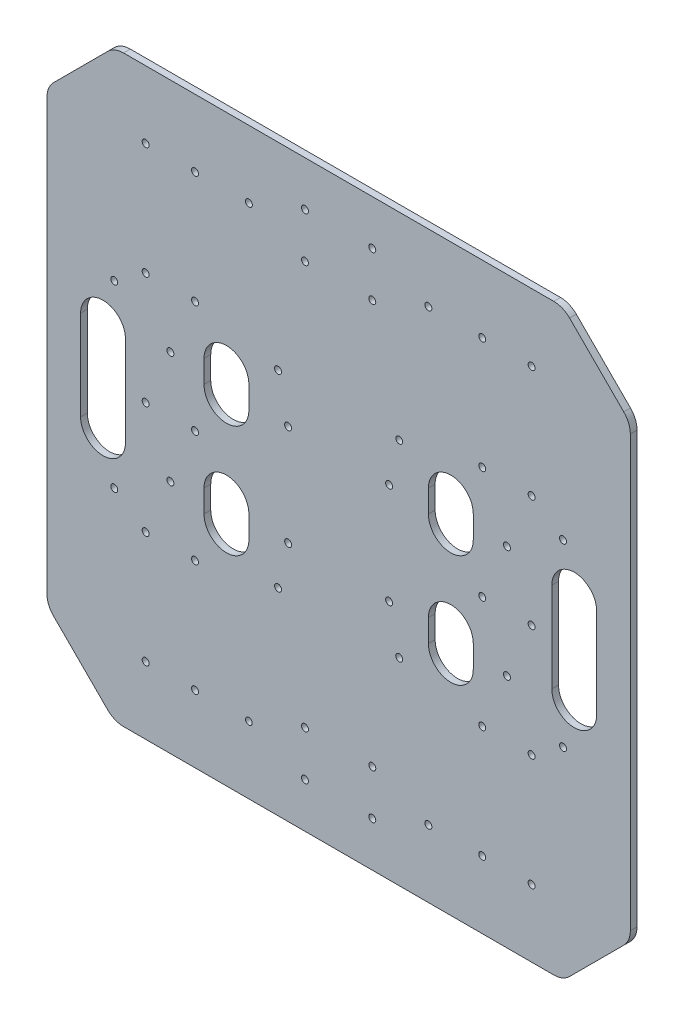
ISO-10303-21;
HEADER;
FILE_DESCRIPTION(('STEP AP214'),'2;1');
FILE_NAME('part.step','',(''),(''),'','','');
FILE_SCHEMA(('AUTOMOTIVE_DESIGN { 1 0 10303 214 1 1 1 1 }'));
ENDSEC;
DATA;
#1=APPLICATION_CONTEXT('core data for automotive mechanical design processes');
#2=APPLICATION_PROTOCOL_DEFINITION('international standard','automotive_design',2000,#1);
#3=PRODUCT_CONTEXT('',#1,'mechanical');
#4=PRODUCT('Part','Part','',(#3));
#5=PRODUCT_RELATED_PRODUCT_CATEGORY('part','',(#4));
#6=PRODUCT_DEFINITION_FORMATION('','',#4);
#7=PRODUCT_DEFINITION_CONTEXT('part definition',#1,'design');
#8=PRODUCT_DEFINITION('design','',#6,#7);
#9=PRODUCT_DEFINITION_SHAPE('','',#8);
#10=(LENGTH_UNIT() NAMED_UNIT(*) SI_UNIT(.MILLI.,.METRE.));
#11=(NAMED_UNIT(*) PLANE_ANGLE_UNIT() SI_UNIT($,.RADIAN.));
#12=(NAMED_UNIT(*) SI_UNIT($,.STERADIAN.) SOLID_ANGLE_UNIT());
#13=UNCERTAINTY_MEASURE_WITH_UNIT(LENGTH_MEASURE(1.E-05),#10,'distance_accuracy_value','');
#14=(GEOMETRIC_REPRESENTATION_CONTEXT(3) GLOBAL_UNCERTAINTY_ASSIGNED_CONTEXT((#13)) GLOBAL_UNIT_ASSIGNED_CONTEXT((#10,
#11,#12)) REPRESENTATION_CONTEXT('',''));
#15=CARTESIAN_POINT('',(0.,0.,0.));
#16=DIRECTION('',(0.,0.,1.));
#17=DIRECTION('',(1.,0.,0.));
#18=AXIS2_PLACEMENT_3D('',#15,#16,#17);
#19=CARTESIAN_POINT('',(0.,0.,3.));
#20=DIRECTION('',(0.,0.,-1.));
#21=DIRECTION('',(-1.,0.,0.));
#22=AXIS2_PLACEMENT_3D('',#19,#20,#21);
#23=PLANE('',#22);
#24=DIRECTION('',(0.,-1.,0.));
#25=VECTOR('',#24,1.);
#26=CARTESIAN_POINT('',(-130.,-100.000000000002,3.));
#27=LINE('',#26,#25);
#28=CARTESIAN_POINT('',(-130.,95.857864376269,3.));
#29=VERTEX_POINT('',#28);
#30=CARTESIAN_POINT('',(-130.,-95.8578643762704,3.));
#31=VERTEX_POINT('',#30);
#32=EDGE_CURVE('E956',#29,#31,#27,.T.);
#33=ORIENTED_EDGE('',*,*,#32,.T.);
#34=CARTESIAN_POINT('',(-120.,-95.8578643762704,3.));
#35=DIRECTION('',(0.,0.,-1.));
#36=DIRECTION('',(-1.,0.,0.));
#37=AXIS2_PLACEMENT_3D('',#34,#35,#36);
#38=CIRCLE('',#37,10.);
#39=CARTESIAN_POINT('',(-127.071067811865,-102.928932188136,3.));
#40=VERTEX_POINT('',#39);
#41=EDGE_CURVE('E1074',#31,#40,#38,.F.);
#42=ORIENTED_EDGE('',*,*,#41,.T.);
#43=DIRECTION('',(0.707106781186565,-0.70710678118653,0.));
#44=VECTOR('',#43,1.);
#45=CARTESIAN_POINT('',(-99.9999999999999,-130.,3.));
#46=LINE('',#45,#44);
#47=CARTESIAN_POINT('',(-102.928932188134,-127.071067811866,3.));
#48=VERTEX_POINT('',#47);
#49=EDGE_CURVE('E960',#40,#48,#46,.T.);
#50=ORIENTED_EDGE('',*,*,#49,.T.);
#51=CARTESIAN_POINT('',(-95.8578643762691,-120.,3.));
#52=DIRECTION('',(0.,0.,-1.));
#53=DIRECTION('',(-1.,0.,0.));
#54=AXIS2_PLACEMENT_3D('',#51,#52,#53);
#55=CIRCLE('',#54,10.);
#56=CARTESIAN_POINT('',(-95.8578643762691,-130.,3.));
#57=VERTEX_POINT('',#56);
#58=EDGE_CURVE('E1071',#48,#57,#55,.F.);
#59=ORIENTED_EDGE('',*,*,#58,.T.);
#60=DIRECTION('',(1.,0.,0.));
#61=VECTOR('',#60,1.);
#62=CARTESIAN_POINT('',(100.000000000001,-130.,3.));
#63=LINE('',#62,#61);
#64=CARTESIAN_POINT('',(95.8578643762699,-130.,3.));
#65=VERTEX_POINT('',#64);
#66=EDGE_CURVE('E965',#57,#65,#63,.T.);
#67=ORIENTED_EDGE('',*,*,#66,.T.);
#68=CARTESIAN_POINT('',(95.8578643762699,-120.,3.));
#69=DIRECTION('',(0.,0.,-1.));
#70=DIRECTION('',(-1.,0.,0.));
#71=AXIS2_PLACEMENT_3D('',#68,#69,#70);
#72=CIRCLE('',#71,10.);
#73=CARTESIAN_POINT('',(102.928932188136,-127.071067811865,3.));
#74=VERTEX_POINT('',#73);
#75=EDGE_CURVE('E1068',#65,#74,#72,.F.);
#76=ORIENTED_EDGE('',*,*,#75,.T.);
#77=DIRECTION('',(0.707106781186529,0.707106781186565,0.));
#78=VECTOR('',#77,1.);
#79=CARTESIAN_POINT('',(130.,-99.9999999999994,3.));
#80=LINE('',#79,#78);
#81=CARTESIAN_POINT('',(127.071067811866,-102.928932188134,3.));
#82=VERTEX_POINT('',#81);
#83=EDGE_CURVE('E969',#74,#82,#80,.T.);
#84=ORIENTED_EDGE('',*,*,#83,.T.);
#85=CARTESIAN_POINT('',(120.,-95.8578643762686,3.));
#86=DIRECTION('',(0.,0.,-1.));
#87=DIRECTION('',(-1.,0.,0.));
#88=AXIS2_PLACEMENT_3D('',#85,#86,#87);
#89=CIRCLE('',#88,10.);
#90=CARTESIAN_POINT('',(130.,-95.8578643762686,3.));
#91=VERTEX_POINT('',#90);
#92=EDGE_CURVE('E1065',#82,#91,#89,.F.);
#93=ORIENTED_EDGE('',*,*,#92,.T.);
#94=DIRECTION('',(0.,1.,0.));
#95=VECTOR('',#94,1.);
#96=CARTESIAN_POINT('',(130.,100.000000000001,3.));
#97=LINE('',#96,#95);
#98=CARTESIAN_POINT('',(130.,95.8578643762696,3.));
#99=VERTEX_POINT('',#98);
#100=EDGE_CURVE('E973',#91,#99,#97,.T.);
#101=ORIENTED_EDGE('',*,*,#100,.T.);
#102=CARTESIAN_POINT('',(120.,95.8578643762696,3.));
#103=DIRECTION('',(0.,0.,-1.));
#104=DIRECTION('',(-1.,0.,0.));
#105=AXIS2_PLACEMENT_3D('',#102,#103,#104);
#106=CIRCLE('',#105,10.);
#107=CARTESIAN_POINT('',(127.071067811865,102.928932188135,3.));
#108=VERTEX_POINT('',#107);
#109=EDGE_CURVE('E1062',#99,#108,#106,.F.);
#110=ORIENTED_EDGE('',*,*,#109,.T.);
#111=DIRECTION('',(-0.707106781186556,0.707106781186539,0.));
#112=VECTOR('',#111,1.);
#113=CARTESIAN_POINT('',(99.9999999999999,130.,3.));
#114=LINE('',#113,#112);
#115=CARTESIAN_POINT('',(102.928932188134,127.071067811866,3.));
#116=VERTEX_POINT('',#115);
#117=EDGE_CURVE('E977',#108,#116,#114,.T.);
#118=ORIENTED_EDGE('',*,*,#117,.T.);
#119=CARTESIAN_POINT('',(95.857864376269,120.,3.));
#120=DIRECTION('',(0.,0.,-1.));
#121=DIRECTION('',(-1.,0.,0.));
#122=AXIS2_PLACEMENT_3D('',#119,#120,#121);
#123=CIRCLE('',#122,10.);
#124=CARTESIAN_POINT('',(95.857864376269,130.,3.));
#125=VERTEX_POINT('',#124);
#126=EDGE_CURVE('E1059',#116,#125,#123,.F.);
#127=ORIENTED_EDGE('',*,*,#126,.T.);
#128=DIRECTION('',(-1.,0.,0.));
#129=VECTOR('',#128,1.);
#130=CARTESIAN_POINT('',(-100.,130.,3.));
#131=LINE('',#130,#129);
#132=CARTESIAN_POINT('',(-95.8578643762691,130.,3.));
#133=VERTEX_POINT('',#132);
#134=EDGE_CURVE('E981',#125,#133,#131,.T.);
#135=ORIENTED_EDGE('',*,*,#134,.T.);
#136=CARTESIAN_POINT('',(-95.8578643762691,120.,3.));
#137=DIRECTION('',(0.,0.,-1.));
#138=DIRECTION('',(-1.,0.,0.));
#139=AXIS2_PLACEMENT_3D('',#136,#137,#138);
#140=CIRCLE('',#139,10.);
#141=CARTESIAN_POINT('',(-102.928932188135,127.071067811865,3.));
#142=VERTEX_POINT('',#141);
#143=EDGE_CURVE('E60',#133,#142,#140,.F.);
#144=ORIENTED_EDGE('',*,*,#143,.T.);
#145=DIRECTION('',(-0.707106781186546,-0.707106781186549,0.));
#146=VECTOR('',#145,1.);
#147=CARTESIAN_POINT('',(-130.,99.9999999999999,3.));
#148=LINE('',#147,#146);
#149=CARTESIAN_POINT('',(-127.071067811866,102.928932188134,3.));
#150=VERTEX_POINT('',#149);
#151=EDGE_CURVE('E984',#142,#150,#148,.T.);
#152=ORIENTED_EDGE('',*,*,#151,.T.);
#153=CARTESIAN_POINT('',(-120.,95.857864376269,3.));
#154=DIRECTION('',(0.,0.,-1.));
#155=DIRECTION('',(-1.,0.,0.));
#156=AXIS2_PLACEMENT_3D('',#153,#154,#155);
#157=CIRCLE('',#156,10.);
#158=EDGE_CURVE('E1054',#150,#29,#157,.F.);
#159=ORIENTED_EDGE('',*,*,#158,.T.);
#160=EDGE_LOOP('',(#33,#42,#50,#59,#67,#76,#84,#93,#101,#110,#118,#127,#135,#144,#152,#159));
#161=FACE_BOUND('',#160,.T.);
#162=CARTESIAN_POINT('',(-86.,100.,3.));
#163=DIRECTION('',(0.,0.,1.));
#164=DIRECTION('',(1.,0.,0.));
#165=AXIS2_PLACEMENT_3D('',#162,#163,#164);
#166=CIRCLE('',#165,1.54999999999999);
#167=CARTESIAN_POINT('',(-84.45,100.,3.));
#168=VERTEX_POINT('',#167);
#169=EDGE_CURVE('E936',#168,#168,#166,.T.);
#170=ORIENTED_EDGE('',*,*,#169,.F.);
#171=EDGE_LOOP('',(#170));
#172=FACE_BOUND('',#171,.T.);
#173=CARTESIAN_POINT('',(-64.,-50.,3.));
#174=DIRECTION('',(0.,0.,1.));
#175=DIRECTION('',(1.,0.,0.));
#176=AXIS2_PLACEMENT_3D('',#173,#174,#175);
#177=CIRCLE('',#176,1.55000000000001);
#178=CARTESIAN_POINT('',(-62.45,-50.,3.));
#179=VERTEX_POINT('',#178);
#180=EDGE_CURVE('E772',#179,#179,#177,.T.);
#181=ORIENTED_EDGE('',*,*,#180,.F.);
#182=EDGE_LOOP('',(#181));
#183=FACE_BOUND('',#182,.T.);
#184=CARTESIAN_POINT('',(64.,-50.,3.));
#185=DIRECTION('',(0.,0.,1.));
#186=DIRECTION('',(1.,0.,0.));
#187=AXIS2_PLACEMENT_3D('',#184,#185,#186);
#188=CIRCLE('',#187,1.54999999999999);
#189=CARTESIAN_POINT('',(65.55,-50.,3.));
#190=VERTEX_POINT('',#189);
#191=EDGE_CURVE('E781',#190,#190,#188,.T.);
#192=ORIENTED_EDGE('',*,*,#191,.F.);
#193=EDGE_LOOP('',(#192));
#194=FACE_BOUND('',#193,.T.);
#195=CARTESIAN_POINT('',(86.,-50.,3.));
#196=DIRECTION('',(0.,0.,1.));
#197=DIRECTION('',(1.,0.,0.));
#198=AXIS2_PLACEMENT_3D('',#195,#196,#197);
#199=CIRCLE('',#198,1.54999999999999);
#200=CARTESIAN_POINT('',(87.55,-50.,3.));
#201=VERTEX_POINT('',#200);
#202=EDGE_CURVE('E756',#201,#201,#199,.T.);
#203=ORIENTED_EDGE('',*,*,#202,.F.);
#204=EDGE_LOOP('',(#203));
#205=FACE_BOUND('',#204,.T.);
#206=CARTESIAN_POINT('',(64.,0.,3.));
#207=DIRECTION('',(0.,0.,1.));
#208=DIRECTION('',(1.,0.,0.));
#209=AXIS2_PLACEMENT_3D('',#206,#207,#208);
#210=CIRCLE('',#209,1.54999999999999);
#211=CARTESIAN_POINT('',(65.55,0.,3.));
#212=VERTEX_POINT('',#211);
#213=EDGE_CURVE('E765',#212,#212,#210,.T.);
#214=ORIENTED_EDGE('',*,*,#213,.F.);
#215=EDGE_LOOP('',(#214));
#216=FACE_BOUND('',#215,.T.);
#217=CARTESIAN_POINT('',(-64.,50.,3.));
#218=DIRECTION('',(0.,0.,1.));
#219=DIRECTION('',(1.,0.,0.));
#220=AXIS2_PLACEMENT_3D('',#217,#218,#219);
#221=CIRCLE('',#220,1.55000000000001);
#222=CARTESIAN_POINT('',(-62.45,50.,3.));
#223=VERTEX_POINT('',#222);
#224=EDGE_CURVE('E804',#223,#223,#221,.T.);
#225=ORIENTED_EDGE('',*,*,#224,.F.);
#226=EDGE_LOOP('',(#225));
#227=FACE_BOUND('',#226,.T.);
#228=CARTESIAN_POINT('',(-86.,0.,3.));
#229=DIRECTION('',(0.,0.,1.));
#230=DIRECTION('',(1.,0.,0.));
#231=AXIS2_PLACEMENT_3D('',#228,#229,#230);
#232=CIRCLE('',#231,1.54999999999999);
#233=CARTESIAN_POINT('',(-84.45,0.,3.));
#234=VERTEX_POINT('',#233);
#235=EDGE_CURVE('E813',#234,#234,#232,.T.);
#236=ORIENTED_EDGE('',*,*,#235,.F.);
#237=EDGE_LOOP('',(#236));
#238=FACE_BOUND('',#237,.T.);
#239=CARTESIAN_POINT('',(-64.,0.,3.));
#240=DIRECTION('',(0.,0.,1.));
#241=DIRECTION('',(1.,0.,0.));
#242=AXIS2_PLACEMENT_3D('',#239,#240,#241);
#243=CIRCLE('',#242,1.55000000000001);
#244=CARTESIAN_POINT('',(-62.45,0.,3.));
#245=VERTEX_POINT('',#244);
#246=EDGE_CURVE('E788',#245,#245,#243,.T.);
#247=ORIENTED_EDGE('',*,*,#246,.F.);
#248=EDGE_LOOP('',(#247));
#249=FACE_BOUND('',#248,.T.);
#250=CARTESIAN_POINT('',(-86.,-50.,3.));
#251=DIRECTION('',(0.,0.,1.));
#252=DIRECTION('',(1.,0.,0.));
#253=AXIS2_PLACEMENT_3D('',#250,#251,#252);
#254=CIRCLE('',#253,1.54999999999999);
#255=CARTESIAN_POINT('',(-84.45,-50.,3.));
#256=VERTEX_POINT('',#255);
#257=EDGE_CURVE('E797',#256,#256,#254,.T.);
#258=ORIENTED_EDGE('',*,*,#257,.F.);
#259=EDGE_LOOP('',(#258));
#260=FACE_BOUND('',#259,.T.);
#261=CARTESIAN_POINT('',(-75.,-25.,3.));
#262=DIRECTION('',(0.,0.,1.));
#263=DIRECTION('',(1.,0.,0.));
#264=AXIS2_PLACEMENT_3D('',#261,#262,#263);
#265=CIRCLE('',#264,1.54999999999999);
#266=CARTESIAN_POINT('',(-73.45,-25.,3.));
#267=VERTEX_POINT('',#266);
#268=EDGE_CURVE('E708',#267,#267,#265,.T.);
#269=ORIENTED_EDGE('',*,*,#268,.F.);
#270=EDGE_LOOP('',(#269));
#271=FACE_BOUND('',#270,.T.);
#272=CARTESIAN_POINT('',(75.,25.,3.));
#273=DIRECTION('',(0.,0.,1.));
#274=DIRECTION('',(1.,0.,0.));
#275=AXIS2_PLACEMENT_3D('',#272,#273,#274);
#276=CIRCLE('',#275,1.54999999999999);
#277=CARTESIAN_POINT('',(76.55,25.,3.));
#278=VERTEX_POINT('',#277);
#279=EDGE_CURVE('E717',#278,#278,#276,.T.);
#280=ORIENTED_EDGE('',*,*,#279,.F.);
#281=EDGE_LOOP('',(#280));
#282=FACE_BOUND('',#281,.T.);
#283=CARTESIAN_POINT('',(75.,-25.,3.));
#284=DIRECTION('',(0.,0.,1.));
#285=DIRECTION('',(1.,0.,0.));
#286=AXIS2_PLACEMENT_3D('',#283,#284,#285);
#287=CIRCLE('',#286,1.54999999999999);
#288=CARTESIAN_POINT('',(76.55,-25.,3.));
#289=VERTEX_POINT('',#288);
#290=EDGE_CURVE('E700',#289,#289,#287,.T.);
#291=ORIENTED_EDGE('',*,*,#290,.F.);
#292=EDGE_LOOP('',(#291));
#293=FACE_BOUND('',#292,.T.);
#294=CARTESIAN_POINT('',(86.,0.,3.));
#295=DIRECTION('',(0.,0.,1.));
#296=DIRECTION('',(1.,0.,0.));
#297=AXIS2_PLACEMENT_3D('',#294,#295,#296);
#298=CIRCLE('',#297,1.54999999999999);
#299=CARTESIAN_POINT('',(87.55,0.,3.));
#300=VERTEX_POINT('',#299);
#301=EDGE_CURVE('E740',#300,#300,#298,.T.);
#302=ORIENTED_EDGE('',*,*,#301,.F.);
#303=EDGE_LOOP('',(#302));
#304=FACE_BOUND('',#303,.T.);
#305=CARTESIAN_POINT('',(64.,50.,3.));
#306=DIRECTION('',(0.,0.,1.));
#307=DIRECTION('',(1.,0.,0.));
#308=AXIS2_PLACEMENT_3D('',#305,#306,#307);
#309=CIRCLE('',#308,1.54999999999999);
#310=CARTESIAN_POINT('',(65.55,50.,3.));
#311=VERTEX_POINT('',#310);
#312=EDGE_CURVE('E749',#311,#311,#309,.T.);
#313=ORIENTED_EDGE('',*,*,#312,.F.);
#314=EDGE_LOOP('',(#313));
#315=FACE_BOUND('',#314,.T.);
#316=CARTESIAN_POINT('',(86.,50.,3.));
#317=DIRECTION('',(0.,0.,1.));
#318=DIRECTION('',(1.,0.,0.));
#319=AXIS2_PLACEMENT_3D('',#316,#317,#318);
#320=CIRCLE('',#319,1.54999999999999);
#321=CARTESIAN_POINT('',(87.55,50.,3.));
#322=VERTEX_POINT('',#321);
#323=EDGE_CURVE('E724',#322,#322,#320,.T.);
#324=ORIENTED_EDGE('',*,*,#323,.F.);
#325=EDGE_LOOP('',(#324));
#326=FACE_BOUND('',#325,.T.);
#327=CARTESIAN_POINT('',(-75.,25.,3.));
#328=DIRECTION('',(0.,0.,1.));
#329=DIRECTION('',(1.,0.,0.));
#330=AXIS2_PLACEMENT_3D('',#327,#328,#329);
#331=CIRCLE('',#330,1.54999999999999);
#332=CARTESIAN_POINT('',(-73.45,25.,3.));
#333=VERTEX_POINT('',#332);
#334=EDGE_CURVE('E733',#333,#333,#331,.T.);
#335=ORIENTED_EDGE('',*,*,#334,.F.);
#336=EDGE_LOOP('',(#335));
#337=FACE_BOUND('',#336,.T.);
#338=CARTESIAN_POINT('',(-64.,-100.,3.));
#339=DIRECTION('',(0.,0.,1.));
#340=DIRECTION('',(1.,0.,0.));
#341=AXIS2_PLACEMENT_3D('',#338,#339,#340);
#342=CIRCLE('',#341,1.55000000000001);
#343=CARTESIAN_POINT('',(-62.45,-100.,3.));
#344=VERTEX_POINT('',#343);
#345=EDGE_CURVE('E900',#344,#344,#342,.T.);
#346=ORIENTED_EDGE('',*,*,#345,.F.);
#347=EDGE_LOOP('',(#346));
#348=FACE_BOUND('',#347,.T.);
#349=CARTESIAN_POINT('',(86.,-100.,3.));
#350=DIRECTION('',(0.,0.,1.));
#351=DIRECTION('',(1.,0.,0.));
#352=AXIS2_PLACEMENT_3D('',#349,#350,#351);
#353=CIRCLE('',#352,1.54999999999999);
#354=CARTESIAN_POINT('',(87.55,-100.,3.));
#355=VERTEX_POINT('',#354);
#356=EDGE_CURVE('E909',#355,#355,#353,.T.);
#357=ORIENTED_EDGE('',*,*,#356,.F.);
#358=EDGE_LOOP('',(#357));
#359=FACE_BOUND('',#358,.T.);
#360=CARTESIAN_POINT('',(64.,-100.,3.));
#361=DIRECTION('',(0.,0.,1.));
#362=DIRECTION('',(1.,0.,0.));
#363=AXIS2_PLACEMENT_3D('',#360,#361,#362);
#364=CIRCLE('',#363,1.54999999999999);
#365=CARTESIAN_POINT('',(65.55,-100.,3.));
#366=VERTEX_POINT('',#365);
#367=EDGE_CURVE('E884',#366,#366,#364,.T.);
#368=ORIENTED_EDGE('',*,*,#367,.F.);
#369=EDGE_LOOP('',(#368));
#370=FACE_BOUND('',#369,.T.);
#371=CARTESIAN_POINT('',(-99.9999999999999,40.,3.));
#372=DIRECTION('',(0.,0.,1.));
#373=DIRECTION('',(1.,0.,0.));
#374=AXIS2_PLACEMENT_3D('',#371,#372,#373);
#375=CIRCLE('',#374,1.54999999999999);
#376=CARTESIAN_POINT('',(-98.45,40.,3.));
#377=VERTEX_POINT('',#376);
#378=EDGE_CURVE('E893',#377,#377,#375,.T.);
#379=ORIENTED_EDGE('',*,*,#378,.F.);
#380=EDGE_LOOP('',(#379));
#381=FACE_BOUND('',#380,.T.);
#382=CARTESIAN_POINT('',(-64.,100.,3.));
#383=DIRECTION('',(0.,0.,1.));
#384=DIRECTION('',(1.,0.,0.));
#385=AXIS2_PLACEMENT_3D('',#382,#383,#384);
#386=CIRCLE('',#385,1.55000000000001);
#387=CARTESIAN_POINT('',(-62.45,100.,3.));
#388=VERTEX_POINT('',#387);
#389=EDGE_CURVE('E932',#388,#388,#386,.T.);
#390=ORIENTED_EDGE('',*,*,#389,.F.);
#391=EDGE_LOOP('',(#390));
#392=FACE_BOUND('',#391,.T.);
#393=CARTESIAN_POINT('',(64.,100.,3.));
#394=DIRECTION('',(0.,0.,1.));
#395=DIRECTION('',(1.,0.,0.));
#396=AXIS2_PLACEMENT_3D('',#393,#394,#395);
#397=CIRCLE('',#396,1.54999999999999);
#398=CARTESIAN_POINT('',(65.55,100.,3.));
#399=VERTEX_POINT('',#398);
#400=EDGE_CURVE('E941',#399,#399,#397,.T.);
#401=ORIENTED_EDGE('',*,*,#400,.F.);
#402=EDGE_LOOP('',(#401));
#403=FACE_BOUND('',#402,.T.);
#404=CARTESIAN_POINT('',(86.,100.,3.));
#405=DIRECTION('',(0.,0.,1.));
#406=DIRECTION('',(1.,0.,0.));
#407=AXIS2_PLACEMENT_3D('',#404,#405,#406);
#408=CIRCLE('',#407,1.54999999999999);
#409=CARTESIAN_POINT('',(87.55,100.,3.));
#410=VERTEX_POINT('',#409);
#411=EDGE_CURVE('E916',#410,#410,#408,.T.);
#412=ORIENTED_EDGE('',*,*,#411,.F.);
#413=EDGE_LOOP('',(#412));
#414=FACE_BOUND('',#413,.T.);
#415=CARTESIAN_POINT('',(-86.,-100.,3.));
#416=DIRECTION('',(0.,0.,1.));
#417=DIRECTION('',(1.,0.,0.));
#418=AXIS2_PLACEMENT_3D('',#415,#416,#417);
#419=CIRCLE('',#418,1.54999999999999);
#420=CARTESIAN_POINT('',(-84.45,-100.,3.));
#421=VERTEX_POINT('',#420);
#422=EDGE_CURVE('E925',#421,#421,#419,.T.);
#423=ORIENTED_EDGE('',*,*,#422,.F.);
#424=EDGE_LOOP('',(#423));
#425=FACE_BOUND('',#424,.T.);
#426=CARTESIAN_POINT('',(-86.,50.,3.));
#427=DIRECTION('',(0.,0.,1.));
#428=DIRECTION('',(1.,0.,0.));
#429=AXIS2_PLACEMENT_3D('',#426,#427,#428);
#430=CIRCLE('',#429,1.54999999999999);
#431=CARTESIAN_POINT('',(-84.45,50.,3.));
#432=VERTEX_POINT('',#431);
#433=EDGE_CURVE('E845',#432,#432,#430,.T.);
#434=ORIENTED_EDGE('',*,*,#433,.F.);
#435=EDGE_LOOP('',(#434));
#436=FACE_BOUND('',#435,.T.);
#437=CARTESIAN_POINT('',(40.,-100.,3.));
#438=DIRECTION('',(0.,0.,1.));
#439=DIRECTION('',(1.,0.,0.));
#440=AXIS2_PLACEMENT_3D('',#437,#438,#439);
#441=CIRCLE('',#440,1.55);
#442=CARTESIAN_POINT('',(41.55,-100.,3.));
#443=VERTEX_POINT('',#442);
#444=EDGE_CURVE('E837',#443,#443,#441,.T.);
#445=ORIENTED_EDGE('',*,*,#444,.F.);
#446=EDGE_LOOP('',(#445));
#447=FACE_BOUND('',#446,.T.);
#448=CARTESIAN_POINT('',(-40.,100.,3.));
#449=DIRECTION('',(0.,0.,1.));
#450=DIRECTION('',(1.,0.,0.));
#451=AXIS2_PLACEMENT_3D('',#448,#449,#450);
#452=CIRCLE('',#451,1.55);
#453=CARTESIAN_POINT('',(-38.45,100.,3.));
#454=VERTEX_POINT('',#453);
#455=EDGE_CURVE('E829',#454,#454,#452,.T.);
#456=ORIENTED_EDGE('',*,*,#455,.F.);
#457=EDGE_LOOP('',(#456));
#458=FACE_BOUND('',#457,.T.);
#459=CARTESIAN_POINT('',(40.,100.,3.));
#460=DIRECTION('',(0.,0.,1.));
#461=DIRECTION('',(1.,0.,0.));
#462=AXIS2_PLACEMENT_3D('',#459,#460,#461);
#463=CIRCLE('',#462,1.55);
#464=CARTESIAN_POINT('',(41.55,100.,3.));
#465=VERTEX_POINT('',#464);
#466=EDGE_CURVE('E820',#465,#465,#463,.T.);
#467=ORIENTED_EDGE('',*,*,#466,.F.);
#468=EDGE_LOOP('',(#467));
#469=FACE_BOUND('',#468,.T.);
#470=CARTESIAN_POINT('',(99.9999999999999,40.,3.));
#471=DIRECTION('',(0.,0.,1.));
#472=DIRECTION('',(1.,0.,0.));
#473=AXIS2_PLACEMENT_3D('',#470,#471,#472);
#474=CIRCLE('',#473,1.54999999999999);
#475=CARTESIAN_POINT('',(101.55,40.,3.));
#476=VERTEX_POINT('',#475);
#477=EDGE_CURVE('E877',#476,#476,#474,.T.);
#478=ORIENTED_EDGE('',*,*,#477,.F.);
#479=EDGE_LOOP('',(#478));
#480=FACE_BOUND('',#479,.T.);
#481=CARTESIAN_POINT('',(99.9999999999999,-40.,3.));
#482=DIRECTION('',(0.,0.,1.));
#483=DIRECTION('',(1.,0.,0.));
#484=AXIS2_PLACEMENT_3D('',#481,#482,#483);
#485=CIRCLE('',#484,1.54999999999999);
#486=CARTESIAN_POINT('',(101.55,-40.,3.));
#487=VERTEX_POINT('',#486);
#488=EDGE_CURVE('E869',#487,#487,#485,.T.);
#489=ORIENTED_EDGE('',*,*,#488,.F.);
#490=EDGE_LOOP('',(#489));
#491=FACE_BOUND('',#490,.T.);
#492=CARTESIAN_POINT('',(-40.,-100.,3.));
#493=DIRECTION('',(0.,0.,1.));
#494=DIRECTION('',(1.,0.,0.));
#495=AXIS2_PLACEMENT_3D('',#492,#493,#494);
#496=CIRCLE('',#495,1.5);
#497=CARTESIAN_POINT('',(-38.5,-100.,3.));
#498=VERTEX_POINT('',#497);
#499=EDGE_CURVE('E861',#498,#498,#496,.T.);
#500=ORIENTED_EDGE('',*,*,#499,.F.);
#501=EDGE_LOOP('',(#500));
#502=FACE_BOUND('',#501,.T.);
#503=CARTESIAN_POINT('',(-99.9999999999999,-40.,3.));
#504=DIRECTION('',(0.,0.,1.));
#505=DIRECTION('',(1.,0.,0.));
#506=AXIS2_PLACEMENT_3D('',#503,#504,#505);
#507=CIRCLE('',#506,1.54999999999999);
#508=CARTESIAN_POINT('',(-98.4499999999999,-40.,3.));
#509=VERTEX_POINT('',#508);
#510=EDGE_CURVE('E852',#509,#509,#507,.T.);
#511=ORIENTED_EDGE('',*,*,#510,.F.);
#512=EDGE_LOOP('',(#511));
#513=FACE_BOUND('',#512,.T.);
#514=CARTESIAN_POINT('',(-27.,42.,3.));
#515=DIRECTION('',(0.,0.,1.));
#516=DIRECTION('',(1.,0.,0.));
#517=AXIS2_PLACEMENT_3D('',#514,#515,#516);
#518=CIRCLE('',#517,1.55);
#519=CARTESIAN_POINT('',(-25.45,42.,3.));
#520=VERTEX_POINT('',#519);
#521=EDGE_CURVE('E680',#520,#520,#518,.T.);
#522=ORIENTED_EDGE('',*,*,#521,.F.);
#523=EDGE_LOOP('',(#522));
#524=FACE_BOUND('',#523,.T.);
#525=CARTESIAN_POINT('',(-27.,-42.,3.));
#526=DIRECTION('',(0.,0.,1.));
#527=DIRECTION('',(1.,0.,0.));
#528=AXIS2_PLACEMENT_3D('',#525,#526,#527);
#529=CIRCLE('',#528,1.55);
#530=CARTESIAN_POINT('',(-25.45,-42.,3.));
#531=VERTEX_POINT('',#530);
#532=EDGE_CURVE('E632',#531,#531,#529,.T.);
#533=ORIENTED_EDGE('',*,*,#532,.F.);
#534=EDGE_LOOP('',(#533));
#535=FACE_BOUND('',#534,.T.);
#536=CARTESIAN_POINT('',(27.,-42.,3.));
#537=DIRECTION('',(0.,0.,1.));
#538=DIRECTION('',(1.,0.,0.));
#539=AXIS2_PLACEMENT_3D('',#536,#537,#538);
#540=CIRCLE('',#539,1.55);
#541=CARTESIAN_POINT('',(28.55,-42.,3.));
#542=VERTEX_POINT('',#541);
#543=EDGE_CURVE('E649',#542,#542,#540,.T.);
#544=ORIENTED_EDGE('',*,*,#543,.F.);
#545=EDGE_LOOP('',(#544));
#546=FACE_BOUND('',#545,.T.);
#547=CARTESIAN_POINT('',(22.5,-22.5,3.));
#548=DIRECTION('',(0.,0.,1.));
#549=DIRECTION('',(1.,0.,0.));
#550=AXIS2_PLACEMENT_3D('',#547,#548,#549);
#551=CIRCLE('',#550,1.55);
#552=CARTESIAN_POINT('',(24.05,-22.5,3.));
#553=VERTEX_POINT('',#552);
#554=EDGE_CURVE('E641',#553,#553,#551,.T.);
#555=ORIENTED_EDGE('',*,*,#554,.F.);
#556=EDGE_LOOP('',(#555));
#557=FACE_BOUND('',#556,.T.);
#558=CARTESIAN_POINT('',(-22.5,22.5,3.));
#559=DIRECTION('',(0.,0.,1.));
#560=DIRECTION('',(1.,0.,0.));
#561=AXIS2_PLACEMENT_3D('',#558,#559,#560);
#562=CIRCLE('',#561,1.55);
#563=CARTESIAN_POINT('',(-20.95,22.5,3.));
#564=VERTEX_POINT('',#563);
#565=EDGE_CURVE('E681',#564,#564,#562,.T.);
#566=ORIENTED_EDGE('',*,*,#565,.F.);
#567=EDGE_LOOP('',(#566));
#568=FACE_BOUND('',#567,.T.);
#569=CARTESIAN_POINT('',(27.,42.,3.));
#570=DIRECTION('',(0.,0.,1.));
#571=DIRECTION('',(1.,0.,0.));
#572=AXIS2_PLACEMENT_3D('',#569,#570,#571);
#573=CIRCLE('',#572,1.5);
#574=CARTESIAN_POINT('',(28.5,42.,3.));
#575=VERTEX_POINT('',#574);
#576=EDGE_CURVE('E664',#575,#575,#573,.T.);
#577=ORIENTED_EDGE('',*,*,#576,.F.);
#578=EDGE_LOOP('',(#577));
#579=FACE_BOUND('',#578,.T.);
#580=CARTESIAN_POINT('',(22.5,22.5,3.));
#581=DIRECTION('',(0.,0.,1.));
#582=DIRECTION('',(1.,0.,0.));
#583=AXIS2_PLACEMENT_3D('',#580,#581,#582);
#584=CIRCLE('',#583,1.55);
#585=CARTESIAN_POINT('',(24.05,22.5,3.));
#586=VERTEX_POINT('',#585);
#587=EDGE_CURVE('E665',#586,#586,#584,.T.);
#588=ORIENTED_EDGE('',*,*,#587,.F.);
#589=EDGE_LOOP('',(#588));
#590=FACE_BOUND('',#589,.T.);
#591=CARTESIAN_POINT('',(-22.5,-22.5,3.));
#592=DIRECTION('',(0.,0.,1.));
#593=DIRECTION('',(1.,0.,0.));
#594=AXIS2_PLACEMENT_3D('',#591,#592,#593);
#595=CIRCLE('',#594,1.55);
#596=CARTESIAN_POINT('',(-20.95,-22.5,3.));
#597=VERTEX_POINT('',#596);
#598=EDGE_CURVE('E640',#597,#597,#595,.T.);
#599=ORIENTED_EDGE('',*,*,#598,.F.);
#600=EDGE_LOOP('',(#599));
#601=FACE_BOUND('',#600,.T.);
#602=CARTESIAN_POINT('',(-15.,110.,3.));
#603=DIRECTION('',(0.,0.,1.));
#604=DIRECTION('',(1.,0.,0.));
#605=AXIS2_PLACEMENT_3D('',#602,#603,#604);
#606=CIRCLE('',#605,1.55);
#607=CARTESIAN_POINT('',(-13.45,110.,3.));
#608=VERTEX_POINT('',#607);
#609=EDGE_CURVE('E616',#608,#608,#606,.T.);
#610=ORIENTED_EDGE('',*,*,#609,.F.);
#611=EDGE_LOOP('',(#610));
#612=FACE_BOUND('',#611,.T.);
#613=CARTESIAN_POINT('',(15.,-90.,3.));
#614=DIRECTION('',(0.,0.,1.));
#615=DIRECTION('',(1.,0.,0.));
#616=AXIS2_PLACEMENT_3D('',#613,#614,#615);
#617=CIRCLE('',#616,1.55);
#618=CARTESIAN_POINT('',(16.55,-90.,3.));
#619=VERTEX_POINT('',#618);
#620=EDGE_CURVE('E585',#619,#619,#617,.T.);
#621=ORIENTED_EDGE('',*,*,#620,.F.);
#622=EDGE_LOOP('',(#621));
#623=FACE_BOUND('',#622,.T.);
#624=CARTESIAN_POINT('',(-14.9999999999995,-110.,3.));
#625=DIRECTION('',(0.,0.,1.));
#626=DIRECTION('',(1.,0.,0.));
#627=AXIS2_PLACEMENT_3D('',#624,#625,#626);
#628=CIRCLE('',#627,1.55);
#629=CARTESIAN_POINT('',(-13.4499999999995,-110.,3.));
#630=VERTEX_POINT('',#629);
#631=EDGE_CURVE('E576',#630,#630,#628,.T.);
#632=ORIENTED_EDGE('',*,*,#631,.F.);
#633=EDGE_LOOP('',(#632));
#634=FACE_BOUND('',#633,.T.);
#635=CARTESIAN_POINT('',(15.,-110.,3.));
#636=DIRECTION('',(0.,0.,1.));
#637=DIRECTION('',(1.,0.,0.));
#638=AXIS2_PLACEMENT_3D('',#635,#636,#637);
#639=CIRCLE('',#638,1.55);
#640=CARTESIAN_POINT('',(16.55,-110.,3.));
#641=VERTEX_POINT('',#640);
#642=EDGE_CURVE('E562',#641,#641,#639,.T.);
#643=ORIENTED_EDGE('',*,*,#642,.F.);
#644=EDGE_LOOP('',(#643));
#645=FACE_BOUND('',#644,.T.);
#646=CARTESIAN_POINT('',(15.,110.,3.));
#647=DIRECTION('',(0.,0.,1.));
#648=DIRECTION('',(1.,0.,0.));
#649=AXIS2_PLACEMENT_3D('',#646,#647,#648);
#650=CIRCLE('',#649,1.55);
#651=CARTESIAN_POINT('',(16.55,110.,3.));
#652=VERTEX_POINT('',#651);
#653=EDGE_CURVE('E617',#652,#652,#650,.T.);
#654=ORIENTED_EDGE('',*,*,#653,.F.);
#655=EDGE_LOOP('',(#654));
#656=FACE_BOUND('',#655,.T.);
#657=CARTESIAN_POINT('',(-15.,90.,3.));
#658=DIRECTION('',(0.,0.,1.));
#659=DIRECTION('',(1.,0.,0.));
#660=AXIS2_PLACEMENT_3D('',#657,#658,#659);
#661=CIRCLE('',#660,1.55);
#662=CARTESIAN_POINT('',(-13.45,90.,3.));
#663=VERTEX_POINT('',#662);
#664=EDGE_CURVE('E600',#663,#663,#661,.T.);
#665=ORIENTED_EDGE('',*,*,#664,.F.);
#666=EDGE_LOOP('',(#665));
#667=FACE_BOUND('',#666,.T.);
#668=CARTESIAN_POINT('',(15.,90.,3.));
#669=DIRECTION('',(0.,0.,1.));
#670=DIRECTION('',(1.,0.,0.));
#671=AXIS2_PLACEMENT_3D('',#668,#669,#670);
#672=CIRCLE('',#671,1.55);
#673=CARTESIAN_POINT('',(16.55,90.,3.));
#674=VERTEX_POINT('',#673);
#675=EDGE_CURVE('E601',#674,#674,#672,.T.);
#676=ORIENTED_EDGE('',*,*,#675,.F.);
#677=EDGE_LOOP('',(#676));
#678=FACE_BOUND('',#677,.T.);
#679=CARTESIAN_POINT('',(-15.,-90.,3.));
#680=DIRECTION('',(0.,0.,1.));
#681=DIRECTION('',(1.,0.,0.));
#682=AXIS2_PLACEMENT_3D('',#679,#680,#681);
#683=CIRCLE('',#682,1.55);
#684=CARTESIAN_POINT('',(-13.45,-90.,3.));
#685=VERTEX_POINT('',#684);
#686=EDGE_CURVE('E584',#685,#685,#683,.T.);
#687=ORIENTED_EDGE('',*,*,#686,.F.);
#688=EDGE_LOOP('',(#687));
#689=FACE_BOUND('',#688,.T.);
#690=CARTESIAN_POINT('',(-50.,30.,3.));
#691=DIRECTION('',(0.,0.,1.));
#692=DIRECTION('',(1.,0.,0.));
#693=AXIS2_PLACEMENT_3D('',#690,#691,#692);
#694=CIRCLE('',#693,10.);
#695=CARTESIAN_POINT('',(-40.,30.,3.));
#696=VERTEX_POINT('',#695);
#697=CARTESIAN_POINT('',(-60.,30.,3.));
#698=VERTEX_POINT('',#697);
#699=EDGE_CURVE('E548',#696,#698,#694,.T.);
#700=ORIENTED_EDGE('',*,*,#699,.F.);
#701=DIRECTION('',(0.,1.,0.));
#702=VECTOR('',#701,1.);
#703=CARTESIAN_POINT('',(-40.,0.,3.));
#704=LINE('',#703,#702);
#705=CARTESIAN_POINT('',(-40.,20.,3.));
#706=VERTEX_POINT('',#705);
#707=EDGE_CURVE('E348',#706,#696,#704,.T.);
#708=ORIENTED_EDGE('',*,*,#707,.F.);
#709=CARTESIAN_POINT('',(-50.,20.,3.));
#710=DIRECTION('',(0.,0.,1.));
#711=DIRECTION('',(1.,0.,0.));
#712=AXIS2_PLACEMENT_3D('',#709,#710,#711);
#713=CIRCLE('',#712,10.);
#714=CARTESIAN_POINT('',(-60.,20.,3.));
#715=VERTEX_POINT('',#714);
#716=EDGE_CURVE('E533',#715,#706,#713,.T.);
#717=ORIENTED_EDGE('',*,*,#716,.F.);
#718=DIRECTION('',(0.,1.,0.));
#719=VECTOR('',#718,1.);
#720=CARTESIAN_POINT('',(-60.,0.,3.));
#721=LINE('',#720,#719);
#722=EDGE_CURVE('E552',#715,#698,#721,.T.);
#723=ORIENTED_EDGE('',*,*,#722,.T.);
#724=EDGE_LOOP('',(#700,#708,#717,#723));
#725=FACE_BOUND('',#724,.T.);
#726=CARTESIAN_POINT('',(50.,30.,3.));
#727=DIRECTION('',(0.,0.,1.));
#728=DIRECTION('',(1.,0.,0.));
#729=AXIS2_PLACEMENT_3D('',#726,#727,#728);
#730=CIRCLE('',#729,10.);
#731=CARTESIAN_POINT('',(60.,30.,3.));
#732=VERTEX_POINT('',#731);
#733=CARTESIAN_POINT('',(40.,30.,3.));
#734=VERTEX_POINT('',#733);
#735=EDGE_CURVE('E338',#732,#734,#730,.T.);
#736=ORIENTED_EDGE('',*,*,#735,.F.);
#737=DIRECTION('',(0.,1.,0.));
#738=VECTOR('',#737,1.);
#739=CARTESIAN_POINT('',(60.,0.,3.));
#740=LINE('',#739,#738);
#741=CARTESIAN_POINT('',(60.,20.,3.));
#742=VERTEX_POINT('',#741);
#743=EDGE_CURVE('E304',#742,#732,#740,.T.);
#744=ORIENTED_EDGE('',*,*,#743,.F.);
#745=CARTESIAN_POINT('',(50.,20.,3.));
#746=DIRECTION('',(0.,0.,1.));
#747=DIRECTION('',(1.,0.,0.));
#748=AXIS2_PLACEMENT_3D('',#745,#746,#747);
#749=CIRCLE('',#748,10.);
#750=CARTESIAN_POINT('',(40.,20.,3.));
#751=VERTEX_POINT('',#750);
#752=EDGE_CURVE('E325',#751,#742,#749,.T.);
#753=ORIENTED_EDGE('',*,*,#752,.F.);
#754=DIRECTION('',(0.,1.,0.));
#755=VECTOR('',#754,1.);
#756=CARTESIAN_POINT('',(40.,0.,3.));
#757=LINE('',#756,#755);
#758=EDGE_CURVE('E329',#751,#734,#757,.T.);
#759=ORIENTED_EDGE('',*,*,#758,.T.);
#760=EDGE_LOOP('',(#736,#744,#753,#759));
#761=FACE_BOUND('',#760,.T.);
#762=CARTESIAN_POINT('',(50.0000000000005,-20.,3.));
#763=DIRECTION('',(0.,0.,1.));
#764=DIRECTION('',(1.,0.,0.));
#765=AXIS2_PLACEMENT_3D('',#762,#763,#764);
#766=CIRCLE('',#765,10.);
#767=CARTESIAN_POINT('',(60.0000000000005,-20.,3.));
#768=VERTEX_POINT('',#767);
#769=CARTESIAN_POINT('',(40.0000000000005,-20.,3.));
#770=VERTEX_POINT('',#769);
#771=EDGE_CURVE('E375',#768,#770,#766,.T.);
#772=ORIENTED_EDGE('',*,*,#771,.F.);
#773=DIRECTION('',(0.,1.,0.));
#774=VECTOR('',#773,1.);
#775=CARTESIAN_POINT('',(60.0000000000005,0.,3.));
#776=LINE('',#775,#774);
#777=CARTESIAN_POINT('',(60.0000000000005,-30.,3.));
#778=VERTEX_POINT('',#777);
#779=EDGE_CURVE('E372',#778,#768,#776,.T.);
#780=ORIENTED_EDGE('',*,*,#779,.F.);
#781=CARTESIAN_POINT('',(50.0000000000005,-30.,3.));
#782=DIRECTION('',(0.,0.,1.));
#783=DIRECTION('',(1.,0.,0.));
#784=AXIS2_PLACEMENT_3D('',#781,#782,#783);
#785=CIRCLE('',#784,10.);
#786=CARTESIAN_POINT('',(40.0000000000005,-30.,3.));
#787=VERTEX_POINT('',#786);
#788=EDGE_CURVE('E359',#787,#778,#785,.T.);
#789=ORIENTED_EDGE('',*,*,#788,.F.);
#790=DIRECTION('',(0.,1.,0.));
#791=VECTOR('',#790,1.);
#792=CARTESIAN_POINT('',(40.0000000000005,0.,3.));
#793=LINE('',#792,#791);
#794=EDGE_CURVE('E380',#787,#770,#793,.T.);
#795=ORIENTED_EDGE('',*,*,#794,.T.);
#796=EDGE_LOOP('',(#772,#780,#789,#795));
#797=FACE_BOUND('',#796,.T.);
#798=CARTESIAN_POINT('',(-49.9999999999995,-20.,3.));
#799=DIRECTION('',(0.,0.,1.));
#800=DIRECTION('',(1.,0.,0.));
#801=AXIS2_PLACEMENT_3D('',#798,#799,#800);
#802=CIRCLE('',#801,10.);
#803=CARTESIAN_POINT('',(-39.9999999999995,-20.,3.));
#804=VERTEX_POINT('',#803);
#805=CARTESIAN_POINT('',(-59.9999999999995,-20.,3.));
#806=VERTEX_POINT('',#805);
#807=EDGE_CURVE('E419',#804,#806,#802,.T.);
#808=ORIENTED_EDGE('',*,*,#807,.F.);
#809=DIRECTION('',(0.,1.,0.));
#810=VECTOR('',#809,1.);
#811=CARTESIAN_POINT('',(-39.9999999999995,0.,3.));
#812=LINE('',#811,#810);
#813=CARTESIAN_POINT('',(-39.9999999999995,-30.,3.));
#814=VERTEX_POINT('',#813);
#815=EDGE_CURVE('E416',#814,#804,#812,.T.);
#816=ORIENTED_EDGE('',*,*,#815,.F.);
#817=CARTESIAN_POINT('',(-49.9999999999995,-30.,3.));
#818=DIRECTION('',(0.,0.,1.));
#819=DIRECTION('',(1.,0.,0.));
#820=AXIS2_PLACEMENT_3D('',#817,#818,#819);
#821=CIRCLE('',#820,10.);
#822=CARTESIAN_POINT('',(-59.9999999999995,-30.,3.));
#823=VERTEX_POINT('',#822);
#824=EDGE_CURVE('E403',#823,#814,#821,.T.);
#825=ORIENTED_EDGE('',*,*,#824,.F.);
#826=DIRECTION('',(0.,1.,0.));
#827=VECTOR('',#826,1.);
#828=CARTESIAN_POINT('',(-59.9999999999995,0.,3.));
#829=LINE('',#828,#827);
#830=EDGE_CURVE('E424',#823,#806,#829,.T.);
#831=ORIENTED_EDGE('',*,*,#830,.T.);
#832=EDGE_LOOP('',(#808,#816,#825,#831));
#833=FACE_BOUND('',#832,.T.);
#834=CARTESIAN_POINT('',(-105.,-20.,3.));
#835=DIRECTION('',(0.,0.,1.));
#836=DIRECTION('',(1.,0.,0.));
#837=AXIS2_PLACEMENT_3D('',#834,#835,#836);
#838=CIRCLE('',#837,9.99999999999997);
#839=CARTESIAN_POINT('',(-115.,-20.,3.));
#840=VERTEX_POINT('',#839);
#841=CARTESIAN_POINT('',(-95.,-20.,3.));
#842=VERTEX_POINT('',#841);
#843=EDGE_CURVE('E463',#840,#842,#838,.T.);
#844=ORIENTED_EDGE('',*,*,#843,.F.);
#845=DIRECTION('',(0.,-1.,0.));
#846=VECTOR('',#845,1.);
#847=CARTESIAN_POINT('',(-115.,0.,3.));
#848=LINE('',#847,#846);
#849=CARTESIAN_POINT('',(-115.,20.,3.));
#850=VERTEX_POINT('',#849);
#851=EDGE_CURVE('E460',#850,#840,#848,.T.);
#852=ORIENTED_EDGE('',*,*,#851,.F.);
#853=CARTESIAN_POINT('',(-105.,20.,3.));
#854=DIRECTION('',(0.,0.,1.));
#855=DIRECTION('',(1.,0.,0.));
#856=AXIS2_PLACEMENT_3D('',#853,#854,#855);
#857=CIRCLE('',#856,9.99999999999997);
#858=CARTESIAN_POINT('',(-95.,20.,3.));
#859=VERTEX_POINT('',#858);
#860=EDGE_CURVE('E447',#859,#850,#857,.T.);
#861=ORIENTED_EDGE('',*,*,#860,.F.);
#862=DIRECTION('',(0.,-1.,0.));
#863=VECTOR('',#862,1.);
#864=CARTESIAN_POINT('',(-95.,0.,3.));
#865=LINE('',#864,#863);
#866=EDGE_CURVE('E468',#859,#842,#865,.T.);
#867=ORIENTED_EDGE('',*,*,#866,.T.);
#868=EDGE_LOOP('',(#844,#852,#861,#867));
#869=FACE_BOUND('',#868,.T.);
#870=CARTESIAN_POINT('',(105.,-20.,3.));
#871=DIRECTION('',(0.,0.,1.));
#872=DIRECTION('',(1.,0.,0.));
#873=AXIS2_PLACEMENT_3D('',#870,#871,#872);
#874=CIRCLE('',#873,9.99999999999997);
#875=CARTESIAN_POINT('',(115.,-20.,3.));
#876=VERTEX_POINT('',#875);
#877=CARTESIAN_POINT('',(95.,-20.,3.));
#878=VERTEX_POINT('',#877);
#879=EDGE_CURVE('E502',#876,#878,#874,.F.);
#880=ORIENTED_EDGE('',*,*,#879,.T.);
#881=DIRECTION('',(0.,-1.,0.));
#882=VECTOR('',#881,1.);
#883=CARTESIAN_POINT('',(95.,0.,3.));
#884=LINE('',#883,#882);
#885=CARTESIAN_POINT('',(95.,20.,3.));
#886=VERTEX_POINT('',#885);
#887=EDGE_CURVE('E490',#886,#878,#884,.T.);
#888=ORIENTED_EDGE('',*,*,#887,.F.);
#889=CARTESIAN_POINT('',(105.,20.,3.));
#890=DIRECTION('',(0.,0.,1.));
#891=DIRECTION('',(1.,0.,0.));
#892=AXIS2_PLACEMENT_3D('',#889,#890,#891);
#893=CIRCLE('',#892,9.99999999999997);
#894=CARTESIAN_POINT('',(115.,20.,3.));
#895=VERTEX_POINT('',#894);
#896=EDGE_CURVE('E510',#886,#895,#893,.F.);
#897=ORIENTED_EDGE('',*,*,#896,.T.);
#898=DIRECTION('',(0.,-1.,0.));
#899=VECTOR('',#898,1.);
#900=CARTESIAN_POINT('',(115.,0.,3.));
#901=LINE('',#900,#899);
#902=EDGE_CURVE('E506',#895,#876,#901,.T.);
#903=ORIENTED_EDGE('',*,*,#902,.T.);
#904=EDGE_LOOP('',(#880,#888,#897,#903));
#905=FACE_BOUND('',#904,.T.);
#906=ADVANCED_FACE('F38',(#161,#172,#183,#194,#205,#216,#227,#238,#249,#260,#271,#282,#293,#304,
#315,#326,#337,#348,#359,#370,#381,#392,#403,#414,#425,#436,#447,#458,#469,#480,#491,#502,#513,
#524,#535,#546,#557,#568,#579,#590,#601,#612,#623,#634,#645,#656,#667,#678,#689,#725,#761,#797,
#833,#869,#905),#23,.F.);
#907=CARTESIAN_POINT('',(0.,0.,0.));
#908=DIRECTION('',(0.,0.,-1.));
#909=DIRECTION('',(-1.,0.,0.));
#910=AXIS2_PLACEMENT_3D('',#907,#908,#909);
#911=PLANE('',#910);
#912=DIRECTION('',(0.,-1.,0.));
#913=VECTOR('',#912,1.);
#914=CARTESIAN_POINT('',(-115.,0.,0.));
#915=LINE('',#914,#913);
#916=CARTESIAN_POINT('',(-115.,20.,0.));
#917=VERTEX_POINT('',#916);
#918=CARTESIAN_POINT('',(-115.,-20.,0.));
#919=VERTEX_POINT('',#918);
#920=EDGE_CURVE('E442',#917,#919,#915,.T.);
#921=ORIENTED_EDGE('',*,*,#920,.T.);
#922=CARTESIAN_POINT('',(-105.,-20.,0.));
#923=DIRECTION('',(0.,0.,1.));
#924=DIRECTION('',(1.,0.,0.));
#925=AXIS2_PLACEMENT_3D('',#922,#923,#924);
#926=CIRCLE('',#925,9.99999999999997);
#927=CARTESIAN_POINT('',(-95.,-20.,0.));
#928=VERTEX_POINT('',#927);
#929=EDGE_CURVE('E446',#919,#928,#926,.T.);
#930=ORIENTED_EDGE('',*,*,#929,.T.);
#931=DIRECTION('',(0.,-1.,0.));
#932=VECTOR('',#931,1.);
#933=CARTESIAN_POINT('',(-95.,0.,0.));
#934=LINE('',#933,#932);
#935=CARTESIAN_POINT('',(-95.,20.,0.));
#936=VERTEX_POINT('',#935);
#937=EDGE_CURVE('E451',#936,#928,#934,.T.);
#938=ORIENTED_EDGE('',*,*,#937,.F.);
#939=CARTESIAN_POINT('',(-105.,20.,0.));
#940=DIRECTION('',(0.,0.,1.));
#941=DIRECTION('',(1.,0.,0.));
#942=AXIS2_PLACEMENT_3D('',#939,#940,#941);
#943=CIRCLE('',#942,9.99999999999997);
#944=EDGE_CURVE('E455',#936,#917,#943,.T.);
#945=ORIENTED_EDGE('',*,*,#944,.T.);
#946=EDGE_LOOP('',(#921,#930,#938,#945));
#947=FACE_BOUND('',#946,.T.);
#948=DIRECTION('',(0.,1.,0.));
#949=VECTOR('',#948,1.);
#950=CARTESIAN_POINT('',(-39.9999999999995,0.,0.));
#951=LINE('',#950,#949);
#952=CARTESIAN_POINT('',(-39.9999999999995,-30.,0.));
#953=VERTEX_POINT('',#952);
#954=CARTESIAN_POINT('',(-39.9999999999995,-20.,0.));
#955=VERTEX_POINT('',#954);
#956=EDGE_CURVE('E398',#953,#955,#951,.T.);
#957=ORIENTED_EDGE('',*,*,#956,.T.);
#958=CARTESIAN_POINT('',(-49.9999999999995,-20.,0.));
#959=DIRECTION('',(0.,0.,1.));
#960=DIRECTION('',(1.,0.,0.));
#961=AXIS2_PLACEMENT_3D('',#958,#959,#960);
#962=CIRCLE('',#961,10.);
#963=CARTESIAN_POINT('',(-59.9999999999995,-20.,0.));
#964=VERTEX_POINT('',#963);
#965=EDGE_CURVE('E402',#955,#964,#962,.T.);
#966=ORIENTED_EDGE('',*,*,#965,.T.);
#967=DIRECTION('',(0.,1.,0.));
#968=VECTOR('',#967,1.);
#969=CARTESIAN_POINT('',(-59.9999999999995,0.,0.));
#970=LINE('',#969,#968);
#971=CARTESIAN_POINT('',(-59.9999999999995,-30.,0.));
#972=VERTEX_POINT('',#971);
#973=EDGE_CURVE('E407',#972,#964,#970,.T.);
#974=ORIENTED_EDGE('',*,*,#973,.F.);
#975=CARTESIAN_POINT('',(-49.9999999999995,-30.,0.));
#976=DIRECTION('',(0.,0.,1.));
#977=DIRECTION('',(1.,0.,0.));
#978=AXIS2_PLACEMENT_3D('',#975,#976,#977);
#979=CIRCLE('',#978,10.);
#980=EDGE_CURVE('E411',#972,#953,#979,.T.);
#981=ORIENTED_EDGE('',*,*,#980,.T.);
#982=EDGE_LOOP('',(#957,#966,#974,#981));
#983=FACE_BOUND('',#982,.T.);
#984=DIRECTION('',(0.,1.,0.));
#985=VECTOR('',#984,1.);
#986=CARTESIAN_POINT('',(60.0000000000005,0.,0.));
#987=LINE('',#986,#985);
#988=CARTESIAN_POINT('',(60.0000000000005,-30.,0.));
#989=VERTEX_POINT('',#988);
#990=CARTESIAN_POINT('',(60.0000000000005,-20.,0.));
#991=VERTEX_POINT('',#990);
#992=EDGE_CURVE('E354',#989,#991,#987,.T.);
#993=ORIENTED_EDGE('',*,*,#992,.T.);
#994=CARTESIAN_POINT('',(50.0000000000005,-20.,0.));
#995=DIRECTION('',(0.,0.,1.));
#996=DIRECTION('',(1.,0.,0.));
#997=AXIS2_PLACEMENT_3D('',#994,#995,#996);
#998=CIRCLE('',#997,10.);
#999=CARTESIAN_POINT('',(40.0000000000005,-20.,0.));
#1000=VERTEX_POINT('',#999);
#1001=EDGE_CURVE('E358',#991,#1000,#998,.T.);
#1002=ORIENTED_EDGE('',*,*,#1001,.T.);
#1003=DIRECTION('',(0.,1.,0.));
#1004=VECTOR('',#1003,1.);
#1005=CARTESIAN_POINT('',(40.0000000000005,0.,0.));
#1006=LINE('',#1005,#1004);
#1007=CARTESIAN_POINT('',(40.0000000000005,-30.,0.));
#1008=VERTEX_POINT('',#1007);
#1009=EDGE_CURVE('E363',#1008,#1000,#1006,.T.);
#1010=ORIENTED_EDGE('',*,*,#1009,.F.);
#1011=CARTESIAN_POINT('',(50.0000000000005,-30.,0.));
#1012=DIRECTION('',(0.,0.,1.));
#1013=DIRECTION('',(1.,0.,0.));
#1014=AXIS2_PLACEMENT_3D('',#1011,#1012,#1013);
#1015=CIRCLE('',#1014,10.);
#1016=EDGE_CURVE('E367',#1008,#989,#1015,.T.);
#1017=ORIENTED_EDGE('',*,*,#1016,.T.);
#1018=EDGE_LOOP('',(#993,#1002,#1010,#1017));
#1019=FACE_BOUND('',#1018,.T.);
#1020=DIRECTION('',(0.,1.,0.));
#1021=VECTOR('',#1020,1.);
#1022=CARTESIAN_POINT('',(60.,0.,0.));
#1023=LINE('',#1022,#1021);
#1024=CARTESIAN_POINT('',(60.,20.,0.));
#1025=VERTEX_POINT('',#1024);
#1026=CARTESIAN_POINT('',(60.,30.,0.));
#1027=VERTEX_POINT('',#1026);
#1028=EDGE_CURVE('E301',#1025,#1027,#1023,.T.);
#1029=ORIENTED_EDGE('',*,*,#1028,.T.);
#1030=CARTESIAN_POINT('',(50.,30.,0.));
#1031=DIRECTION('',(0.,0.,1.));
#1032=DIRECTION('',(1.,0.,0.));
#1033=AXIS2_PLACEMENT_3D('',#1030,#1031,#1032);
#1034=CIRCLE('',#1033,10.);
#1035=CARTESIAN_POINT('',(40.,30.,0.));
#1036=VERTEX_POINT('',#1035);
#1037=EDGE_CURVE('E313',#1027,#1036,#1034,.T.);
#1038=ORIENTED_EDGE('',*,*,#1037,.T.);
#1039=DIRECTION('',(0.,1.,0.));
#1040=VECTOR('',#1039,1.);
#1041=CARTESIAN_POINT('',(40.,0.,0.));
#1042=LINE('',#1041,#1040);
#1043=CARTESIAN_POINT('',(40.,20.,0.));
#1044=VERTEX_POINT('',#1043);
#1045=EDGE_CURVE('E319',#1044,#1036,#1042,.T.);
#1046=ORIENTED_EDGE('',*,*,#1045,.F.);
#1047=CARTESIAN_POINT('',(50.,20.,0.));
#1048=DIRECTION('',(0.,0.,1.));
#1049=DIRECTION('',(1.,0.,0.));
#1050=AXIS2_PLACEMENT_3D('',#1047,#1048,#1049);
#1051=CIRCLE('',#1050,10.);
#1052=EDGE_CURVE('E310',#1044,#1025,#1051,.T.);
#1053=ORIENTED_EDGE('',*,*,#1052,.T.);
#1054=EDGE_LOOP('',(#1029,#1038,#1046,#1053));
#1055=FACE_BOUND('',#1054,.T.);
#1056=DIRECTION('',(0.,1.,0.));
#1057=VECTOR('',#1056,1.);
#1058=CARTESIAN_POINT('',(-40.,0.,0.));
#1059=LINE('',#1058,#1057);
#1060=CARTESIAN_POINT('',(-40.,20.,0.));
#1061=VERTEX_POINT('',#1060);
#1062=CARTESIAN_POINT('',(-40.,30.,0.));
#1063=VERTEX_POINT('',#1062);
#1064=EDGE_CURVE('E528',#1061,#1063,#1059,.T.);
#1065=ORIENTED_EDGE('',*,*,#1064,.T.);
#1066=CARTESIAN_POINT('',(-50.,30.,0.));
#1067=DIRECTION('',(0.,0.,1.));
#1068=DIRECTION('',(1.,0.,0.));
#1069=AXIS2_PLACEMENT_3D('',#1066,#1067,#1068);
#1070=CIRCLE('',#1069,10.);
#1071=CARTESIAN_POINT('',(-60.,30.,0.));
#1072=VERTEX_POINT('',#1071);
#1073=EDGE_CURVE('E532',#1063,#1072,#1070,.T.);
#1074=ORIENTED_EDGE('',*,*,#1073,.T.);
#1075=DIRECTION('',(0.,1.,0.));
#1076=VECTOR('',#1075,1.);
#1077=CARTESIAN_POINT('',(-60.,0.,0.));
#1078=LINE('',#1077,#1076);
#1079=CARTESIAN_POINT('',(-60.,20.,0.));
#1080=VERTEX_POINT('',#1079);
#1081=EDGE_CURVE('E537',#1080,#1072,#1078,.T.);
#1082=ORIENTED_EDGE('',*,*,#1081,.F.);
#1083=CARTESIAN_POINT('',(-50.,20.,0.));
#1084=DIRECTION('',(0.,0.,1.));
#1085=DIRECTION('',(1.,0.,0.));
#1086=AXIS2_PLACEMENT_3D('',#1083,#1084,#1085);
#1087=CIRCLE('',#1086,10.);
#1088=EDGE_CURVE('E541',#1080,#1061,#1087,.T.);
#1089=ORIENTED_EDGE('',*,*,#1088,.T.);
#1090=EDGE_LOOP('',(#1065,#1074,#1082,#1089));
#1091=FACE_BOUND('',#1090,.T.);
#1092=CARTESIAN_POINT('',(-15.,-90.,0.));
#1093=DIRECTION('',(0.,0.,1.));
#1094=DIRECTION('',(1.,0.,0.));
#1095=AXIS2_PLACEMENT_3D('',#1092,#1093,#1094);
#1096=CIRCLE('',#1095,1.55);
#1097=CARTESIAN_POINT('',(-13.45,-90.,0.));
#1098=VERTEX_POINT('',#1097);
#1099=EDGE_CURVE('E605',#1098,#1098,#1096,.T.);
#1100=ORIENTED_EDGE('',*,*,#1099,.T.);
#1101=EDGE_LOOP('',(#1100));
#1102=FACE_BOUND('',#1101,.T.);
#1103=CARTESIAN_POINT('',(15.,90.,0.));
#1104=DIRECTION('',(0.,0.,1.));
#1105=DIRECTION('',(1.,0.,0.));
#1106=AXIS2_PLACEMENT_3D('',#1103,#1104,#1105);
#1107=CIRCLE('',#1106,1.55);
#1108=CARTESIAN_POINT('',(16.55,90.,0.));
#1109=VERTEX_POINT('',#1108);
#1110=EDGE_CURVE('E596',#1109,#1109,#1107,.T.);
#1111=ORIENTED_EDGE('',*,*,#1110,.T.);
#1112=EDGE_LOOP('',(#1111));
#1113=FACE_BOUND('',#1112,.T.);
#1114=CARTESIAN_POINT('',(-15.,90.,0.));
#1115=DIRECTION('',(0.,0.,1.));
#1116=DIRECTION('',(1.,0.,0.));
#1117=AXIS2_PLACEMENT_3D('',#1114,#1115,#1116);
#1118=CIRCLE('',#1117,1.55);
#1119=CARTESIAN_POINT('',(-13.45,90.,0.));
#1120=VERTEX_POINT('',#1119);
#1121=EDGE_CURVE('E621',#1120,#1120,#1118,.T.);
#1122=ORIENTED_EDGE('',*,*,#1121,.T.);
#1123=EDGE_LOOP('',(#1122));
#1124=FACE_BOUND('',#1123,.T.);
#1125=CARTESIAN_POINT('',(15.,110.,0.));
#1126=DIRECTION('',(0.,0.,1.));
#1127=DIRECTION('',(1.,0.,0.));
#1128=AXIS2_PLACEMENT_3D('',#1125,#1126,#1127);
#1129=CIRCLE('',#1128,1.55);
#1130=CARTESIAN_POINT('',(16.55,110.,0.));
#1131=VERTEX_POINT('',#1130);
#1132=EDGE_CURVE('E612',#1131,#1131,#1129,.T.);
#1133=ORIENTED_EDGE('',*,*,#1132,.T.);
#1134=EDGE_LOOP('',(#1133));
#1135=FACE_BOUND('',#1134,.T.);
#1136=CARTESIAN_POINT('',(15.,-110.,0.));
#1137=DIRECTION('',(0.,0.,1.));
#1138=DIRECTION('',(1.,0.,0.));
#1139=AXIS2_PLACEMENT_3D('',#1136,#1137,#1138);
#1140=CIRCLE('',#1139,1.55);
#1141=CARTESIAN_POINT('',(16.55,-110.,0.));
#1142=VERTEX_POINT('',#1141);
#1143=EDGE_CURVE('E572',#1142,#1142,#1140,.T.);
#1144=ORIENTED_EDGE('',*,*,#1143,.T.);
#1145=EDGE_LOOP('',(#1144));
#1146=FACE_BOUND('',#1145,.T.);
#1147=CARTESIAN_POINT('',(-14.9999999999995,-110.,0.));
#1148=DIRECTION('',(0.,0.,1.));
#1149=DIRECTION('',(1.,0.,0.));
#1150=AXIS2_PLACEMENT_3D('',#1147,#1148,#1149);
#1151=CIRCLE('',#1150,1.55);
#1152=CARTESIAN_POINT('',(-13.4499999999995,-110.,0.));
#1153=VERTEX_POINT('',#1152);
#1154=EDGE_CURVE('E589',#1153,#1153,#1151,.T.);
#1155=ORIENTED_EDGE('',*,*,#1154,.T.);
#1156=EDGE_LOOP('',(#1155));
#1157=FACE_BOUND('',#1156,.T.);
#1158=CARTESIAN_POINT('',(15.,-90.,0.));
#1159=DIRECTION('',(0.,0.,1.));
#1160=DIRECTION('',(1.,0.,0.));
#1161=AXIS2_PLACEMENT_3D('',#1158,#1159,#1160);
#1162=CIRCLE('',#1161,1.55);
#1163=CARTESIAN_POINT('',(16.55,-90.,0.));
#1164=VERTEX_POINT('',#1163);
#1165=EDGE_CURVE('E580',#1164,#1164,#1162,.T.);
#1166=ORIENTED_EDGE('',*,*,#1165,.T.);
#1167=EDGE_LOOP('',(#1166));
#1168=FACE_BOUND('',#1167,.T.);
#1169=CARTESIAN_POINT('',(-15.,110.,0.));
#1170=DIRECTION('',(0.,0.,1.));
#1171=DIRECTION('',(1.,0.,0.));
#1172=AXIS2_PLACEMENT_3D('',#1169,#1170,#1171);
#1173=CIRCLE('',#1172,1.55);
#1174=CARTESIAN_POINT('',(-13.45,110.,0.));
#1175=VERTEX_POINT('',#1174);
#1176=EDGE_CURVE('E628',#1175,#1175,#1173,.T.);
#1177=ORIENTED_EDGE('',*,*,#1176,.T.);
#1178=EDGE_LOOP('',(#1177));
#1179=FACE_BOUND('',#1178,.T.);
#1180=CARTESIAN_POINT('',(-22.5,-22.5,0.));
#1181=DIRECTION('',(0.,0.,1.));
#1182=DIRECTION('',(1.,0.,0.));
#1183=AXIS2_PLACEMENT_3D('',#1180,#1181,#1182);
#1184=CIRCLE('',#1183,1.55);
#1185=CARTESIAN_POINT('',(-20.95,-22.5,0.));
#1186=VERTEX_POINT('',#1185);
#1187=EDGE_CURVE('E669',#1186,#1186,#1184,.T.);
#1188=ORIENTED_EDGE('',*,*,#1187,.T.);
#1189=EDGE_LOOP('',(#1188));
#1190=FACE_BOUND('',#1189,.T.);
#1191=CARTESIAN_POINT('',(22.5,22.5,0.));
#1192=DIRECTION('',(0.,0.,1.));
#1193=DIRECTION('',(1.,0.,0.));
#1194=AXIS2_PLACEMENT_3D('',#1191,#1192,#1193);
#1195=CIRCLE('',#1194,1.55);
#1196=CARTESIAN_POINT('',(24.05,22.5,0.));
#1197=VERTEX_POINT('',#1196);
#1198=EDGE_CURVE('E660',#1197,#1197,#1195,.T.);
#1199=ORIENTED_EDGE('',*,*,#1198,.T.);
#1200=EDGE_LOOP('',(#1199));
#1201=FACE_BOUND('',#1200,.T.);
#1202=CARTESIAN_POINT('',(27.,42.,0.));
#1203=DIRECTION('',(0.,0.,1.));
#1204=DIRECTION('',(1.,0.,0.));
#1205=AXIS2_PLACEMENT_3D('',#1202,#1203,#1204);
#1206=CIRCLE('',#1205,1.5);
#1207=CARTESIAN_POINT('',(28.5,42.,0.));
#1208=VERTEX_POINT('',#1207);
#1209=EDGE_CURVE('E685',#1208,#1208,#1206,.T.);
#1210=ORIENTED_EDGE('',*,*,#1209,.T.);
#1211=EDGE_LOOP('',(#1210));
#1212=FACE_BOUND('',#1211,.T.);
#1213=CARTESIAN_POINT('',(-22.5,22.5,0.));
#1214=DIRECTION('',(0.,0.,1.));
#1215=DIRECTION('',(1.,0.,0.));
#1216=AXIS2_PLACEMENT_3D('',#1213,#1214,#1215);
#1217=CIRCLE('',#1216,1.55);
#1218=CARTESIAN_POINT('',(-20.95,22.5,0.));
#1219=VERTEX_POINT('',#1218);
#1220=EDGE_CURVE('E676',#1219,#1219,#1217,.T.);
#1221=ORIENTED_EDGE('',*,*,#1220,.T.);
#1222=EDGE_LOOP('',(#1221));
#1223=FACE_BOUND('',#1222,.T.);
#1224=CARTESIAN_POINT('',(22.5,-22.5,0.));
#1225=DIRECTION('',(0.,0.,1.));
#1226=DIRECTION('',(1.,0.,0.));
#1227=AXIS2_PLACEMENT_3D('',#1224,#1225,#1226);
#1228=CIRCLE('',#1227,1.55);
#1229=CARTESIAN_POINT('',(24.05,-22.5,0.));
#1230=VERTEX_POINT('',#1229);
#1231=EDGE_CURVE('E636',#1230,#1230,#1228,.T.);
#1232=ORIENTED_EDGE('',*,*,#1231,.T.);
#1233=EDGE_LOOP('',(#1232));
#1234=FACE_BOUND('',#1233,.T.);
#1235=CARTESIAN_POINT('',(27.,-42.,0.));
#1236=DIRECTION('',(0.,0.,1.));
#1237=DIRECTION('',(1.,0.,0.));
#1238=AXIS2_PLACEMENT_3D('',#1235,#1236,#1237);
#1239=CIRCLE('',#1238,1.55);
#1240=CARTESIAN_POINT('',(28.55,-42.,0.));
#1241=VERTEX_POINT('',#1240);
#1242=EDGE_CURVE('E645',#1241,#1241,#1239,.T.);
#1243=ORIENTED_EDGE('',*,*,#1242,.T.);
#1244=EDGE_LOOP('',(#1243));
#1245=FACE_BOUND('',#1244,.T.);
#1246=CARTESIAN_POINT('',(-27.,-42.,0.));
#1247=DIRECTION('',(0.,0.,1.));
#1248=DIRECTION('',(1.,0.,0.));
#1249=AXIS2_PLACEMENT_3D('',#1246,#1247,#1248);
#1250=CIRCLE('',#1249,1.55);
#1251=CARTESIAN_POINT('',(-25.45,-42.,0.));
#1252=VERTEX_POINT('',#1251);
#1253=EDGE_CURVE('E653',#1252,#1252,#1250,.T.);
#1254=ORIENTED_EDGE('',*,*,#1253,.T.);
#1255=EDGE_LOOP('',(#1254));
#1256=FACE_BOUND('',#1255,.T.);
#1257=CARTESIAN_POINT('',(-27.,42.,0.));
#1258=DIRECTION('',(0.,0.,1.));
#1259=DIRECTION('',(1.,0.,0.));
#1260=AXIS2_PLACEMENT_3D('',#1257,#1258,#1259);
#1261=CIRCLE('',#1260,1.55);
#1262=CARTESIAN_POINT('',(-25.45,42.,0.));
#1263=VERTEX_POINT('',#1262);
#1264=EDGE_CURVE('E692',#1263,#1263,#1261,.T.);
#1265=ORIENTED_EDGE('',*,*,#1264,.T.);
#1266=EDGE_LOOP('',(#1265));
#1267=FACE_BOUND('',#1266,.T.);
#1268=CARTESIAN_POINT('',(-99.9999999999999,-40.,0.));
#1269=DIRECTION('',(0.,0.,1.));
#1270=DIRECTION('',(1.,0.,0.));
#1271=AXIS2_PLACEMENT_3D('',#1268,#1269,#1270);
#1272=CIRCLE('',#1271,1.54999999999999);
#1273=CARTESIAN_POINT('',(-98.4499999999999,-40.,0.));
#1274=VERTEX_POINT('',#1273);
#1275=EDGE_CURVE('E857',#1274,#1274,#1272,.T.);
#1276=ORIENTED_EDGE('',*,*,#1275,.T.);
#1277=EDGE_LOOP('',(#1276));
#1278=FACE_BOUND('',#1277,.T.);
#1279=CARTESIAN_POINT('',(-40.,-100.,0.));
#1280=DIRECTION('',(0.,0.,1.));
#1281=DIRECTION('',(1.,0.,0.));
#1282=AXIS2_PLACEMENT_3D('',#1279,#1280,#1281);
#1283=CIRCLE('',#1282,1.5);
#1284=CARTESIAN_POINT('',(-38.5,-100.,0.));
#1285=VERTEX_POINT('',#1284);
#1286=EDGE_CURVE('E865',#1285,#1285,#1283,.T.);
#1287=ORIENTED_EDGE('',*,*,#1286,.T.);
#1288=EDGE_LOOP('',(#1287));
#1289=FACE_BOUND('',#1288,.T.);
#1290=CARTESIAN_POINT('',(99.9999999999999,-40.,0.));
#1291=DIRECTION('',(0.,0.,1.));
#1292=DIRECTION('',(1.,0.,0.));
#1293=AXIS2_PLACEMENT_3D('',#1290,#1291,#1292);
#1294=CIRCLE('',#1293,1.54999999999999);
#1295=CARTESIAN_POINT('',(101.55,-40.,0.));
#1296=VERTEX_POINT('',#1295);
#1297=EDGE_CURVE('E873',#1296,#1296,#1294,.T.);
#1298=ORIENTED_EDGE('',*,*,#1297,.T.);
#1299=EDGE_LOOP('',(#1298));
#1300=FACE_BOUND('',#1299,.T.);
#1301=CARTESIAN_POINT('',(99.9999999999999,40.,0.));
#1302=DIRECTION('',(0.,0.,1.));
#1303=DIRECTION('',(1.,0.,0.));
#1304=AXIS2_PLACEMENT_3D('',#1301,#1302,#1303);
#1305=CIRCLE('',#1304,1.54999999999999);
#1306=CARTESIAN_POINT('',(101.55,40.,0.));
#1307=VERTEX_POINT('',#1306);
#1308=EDGE_CURVE('E824',#1307,#1307,#1305,.T.);
#1309=ORIENTED_EDGE('',*,*,#1308,.T.);
#1310=EDGE_LOOP('',(#1309));
#1311=FACE_BOUND('',#1310,.T.);
#1312=CARTESIAN_POINT('',(40.,100.,0.));
#1313=DIRECTION('',(0.,0.,1.));
#1314=DIRECTION('',(1.,0.,0.));
#1315=AXIS2_PLACEMENT_3D('',#1312,#1313,#1314);
#1316=CIRCLE('',#1315,1.55);
#1317=CARTESIAN_POINT('',(41.55,100.,0.));
#1318=VERTEX_POINT('',#1317);
#1319=EDGE_CURVE('E825',#1318,#1318,#1316,.T.);
#1320=ORIENTED_EDGE('',*,*,#1319,.T.);
#1321=EDGE_LOOP('',(#1320));
#1322=FACE_BOUND('',#1321,.T.);
#1323=CARTESIAN_POINT('',(-40.,100.,0.));
#1324=DIRECTION('',(0.,0.,1.));
#1325=DIRECTION('',(1.,0.,0.));
#1326=AXIS2_PLACEMENT_3D('',#1323,#1324,#1325);
#1327=CIRCLE('',#1326,1.55);
#1328=CARTESIAN_POINT('',(-38.45,100.,0.));
#1329=VERTEX_POINT('',#1328);
#1330=EDGE_CURVE('E833',#1329,#1329,#1327,.T.);
#1331=ORIENTED_EDGE('',*,*,#1330,.T.);
#1332=EDGE_LOOP('',(#1331));
#1333=FACE_BOUND('',#1332,.T.);
#1334=CARTESIAN_POINT('',(40.,-100.,0.));
#1335=DIRECTION('',(0.,0.,1.));
#1336=DIRECTION('',(1.,0.,0.));
#1337=AXIS2_PLACEMENT_3D('',#1334,#1335,#1336);
#1338=CIRCLE('',#1337,1.55);
#1339=CARTESIAN_POINT('',(41.55,-100.,0.));
#1340=VERTEX_POINT('',#1339);
#1341=EDGE_CURVE('E841',#1340,#1340,#1338,.T.);
#1342=ORIENTED_EDGE('',*,*,#1341,.T.);
#1343=EDGE_LOOP('',(#1342));
#1344=FACE_BOUND('',#1343,.T.);
#1345=CARTESIAN_POINT('',(-86.,50.,0.));
#1346=DIRECTION('',(0.,0.,1.));
#1347=DIRECTION('',(1.,0.,0.));
#1348=AXIS2_PLACEMENT_3D('',#1345,#1346,#1347);
#1349=CIRCLE('',#1348,1.54999999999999);
#1350=CARTESIAN_POINT('',(-84.45,50.,0.));
#1351=VERTEX_POINT('',#1350);
#1352=EDGE_CURVE('E808',#1351,#1351,#1349,.T.);
#1353=ORIENTED_EDGE('',*,*,#1352,.T.);
#1354=EDGE_LOOP('',(#1353));
#1355=FACE_BOUND('',#1354,.T.);
#1356=CARTESIAN_POINT('',(-86.,-100.,0.));
#1357=DIRECTION('',(0.,0.,1.));
#1358=DIRECTION('',(1.,0.,0.));
#1359=AXIS2_PLACEMENT_3D('',#1356,#1357,#1358);
#1360=CIRCLE('',#1359,1.54999999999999);
#1361=CARTESIAN_POINT('',(-84.45,-100.,0.));
#1362=VERTEX_POINT('',#1361);
#1363=EDGE_CURVE('E904',#1362,#1362,#1360,.T.);
#1364=ORIENTED_EDGE('',*,*,#1363,.T.);
#1365=EDGE_LOOP('',(#1364));
#1366=FACE_BOUND('',#1365,.T.);
#1367=CARTESIAN_POINT('',(86.,100.,0.));
#1368=DIRECTION('',(0.,0.,1.));
#1369=DIRECTION('',(1.,0.,0.));
#1370=AXIS2_PLACEMENT_3D('',#1367,#1368,#1369);
#1371=CIRCLE('',#1370,1.54999999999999);
#1372=CARTESIAN_POINT('',(87.55,100.,0.));
#1373=VERTEX_POINT('',#1372);
#1374=EDGE_CURVE('E921',#1373,#1373,#1371,.T.);
#1375=ORIENTED_EDGE('',*,*,#1374,.T.);
#1376=EDGE_LOOP('',(#1375));
#1377=FACE_BOUND('',#1376,.T.);
#1378=CARTESIAN_POINT('',(64.,100.,0.));
#1379=DIRECTION('',(0.,0.,1.));
#1380=DIRECTION('',(1.,0.,0.));
#1381=AXIS2_PLACEMENT_3D('',#1378,#1379,#1380);
#1382=CIRCLE('',#1381,1.54999999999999);
#1383=CARTESIAN_POINT('',(65.55,100.,0.));
#1384=VERTEX_POINT('',#1383);
#1385=EDGE_CURVE('E920',#1384,#1384,#1382,.T.);
#1386=ORIENTED_EDGE('',*,*,#1385,.T.);
#1387=EDGE_LOOP('',(#1386));
#1388=FACE_BOUND('',#1387,.T.);
#1389=CARTESIAN_POINT('',(-64.,100.,0.));
#1390=DIRECTION('',(0.,0.,1.));
#1391=DIRECTION('',(1.,0.,0.));
#1392=AXIS2_PLACEMENT_3D('',#1389,#1390,#1391);
#1393=CIRCLE('',#1392,1.55000000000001);
#1394=CARTESIAN_POINT('',(-62.45,100.,0.));
#1395=VERTEX_POINT('',#1394);
#1396=EDGE_CURVE('E937',#1395,#1395,#1393,.T.);
#1397=ORIENTED_EDGE('',*,*,#1396,.T.);
#1398=EDGE_LOOP('',(#1397));
#1399=FACE_BOUND('',#1398,.T.);
#1400=CARTESIAN_POINT('',(-99.9999999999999,40.,0.));
#1401=DIRECTION('',(0.,0.,1.));
#1402=DIRECTION('',(1.,0.,0.));
#1403=AXIS2_PLACEMENT_3D('',#1400,#1401,#1402);
#1404=CIRCLE('',#1403,1.54999999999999);
#1405=CARTESIAN_POINT('',(-98.45,40.,0.));
#1406=VERTEX_POINT('',#1405);
#1407=EDGE_CURVE('E856',#1406,#1406,#1404,.T.);
#1408=ORIENTED_EDGE('',*,*,#1407,.T.);
#1409=EDGE_LOOP('',(#1408));
#1410=FACE_BOUND('',#1409,.T.);
#1411=CARTESIAN_POINT('',(64.,-100.,0.));
#1412=DIRECTION('',(0.,0.,1.));
#1413=DIRECTION('',(1.,0.,0.));
#1414=AXIS2_PLACEMENT_3D('',#1411,#1412,#1413);
#1415=CIRCLE('',#1414,1.54999999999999);
#1416=CARTESIAN_POINT('',(65.55,-100.,0.));
#1417=VERTEX_POINT('',#1416);
#1418=EDGE_CURVE('E889',#1417,#1417,#1415,.T.);
#1419=ORIENTED_EDGE('',*,*,#1418,.T.);
#1420=EDGE_LOOP('',(#1419));
#1421=FACE_BOUND('',#1420,.T.);
#1422=CARTESIAN_POINT('',(86.,-100.,0.));
#1423=DIRECTION('',(0.,0.,1.));
#1424=DIRECTION('',(1.,0.,0.));
#1425=AXIS2_PLACEMENT_3D('',#1422,#1423,#1424);
#1426=CIRCLE('',#1425,1.54999999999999);
#1427=CARTESIAN_POINT('',(87.55,-100.,0.));
#1428=VERTEX_POINT('',#1427);
#1429=EDGE_CURVE('E888',#1428,#1428,#1426,.T.);
#1430=ORIENTED_EDGE('',*,*,#1429,.T.);
#1431=EDGE_LOOP('',(#1430));
#1432=FACE_BOUND('',#1431,.T.);
#1433=CARTESIAN_POINT('',(-64.,-100.,0.));
#1434=DIRECTION('',(0.,0.,1.));
#1435=DIRECTION('',(1.,0.,0.));
#1436=AXIS2_PLACEMENT_3D('',#1433,#1434,#1435);
#1437=CIRCLE('',#1436,1.55000000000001);
#1438=CARTESIAN_POINT('',(-62.45,-100.,0.));
#1439=VERTEX_POINT('',#1438);
#1440=EDGE_CURVE('E905',#1439,#1439,#1437,.T.);
#1441=ORIENTED_EDGE('',*,*,#1440,.T.);
#1442=EDGE_LOOP('',(#1441));
#1443=FACE_BOUND('',#1442,.T.);
#1444=CARTESIAN_POINT('',(-75.,25.,0.));
#1445=DIRECTION('',(0.,0.,1.));
#1446=DIRECTION('',(1.,0.,0.));
#1447=AXIS2_PLACEMENT_3D('',#1444,#1445,#1446);
#1448=CIRCLE('',#1447,1.54999999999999);
#1449=CARTESIAN_POINT('',(-73.45,25.,0.));
#1450=VERTEX_POINT('',#1449);
#1451=EDGE_CURVE('E712',#1450,#1450,#1448,.T.);
#1452=ORIENTED_EDGE('',*,*,#1451,.T.);
#1453=EDGE_LOOP('',(#1452));
#1454=FACE_BOUND('',#1453,.T.);
#1455=CARTESIAN_POINT('',(86.,50.,0.));
#1456=DIRECTION('',(0.,0.,1.));
#1457=DIRECTION('',(1.,0.,0.));
#1458=AXIS2_PLACEMENT_3D('',#1455,#1456,#1457);
#1459=CIRCLE('',#1458,1.54999999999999);
#1460=CARTESIAN_POINT('',(87.55,50.,0.));
#1461=VERTEX_POINT('',#1460);
#1462=EDGE_CURVE('E729',#1461,#1461,#1459,.T.);
#1463=ORIENTED_EDGE('',*,*,#1462,.T.);
#1464=EDGE_LOOP('',(#1463));
#1465=FACE_BOUND('',#1464,.T.);
#1466=CARTESIAN_POINT('',(64.,50.,0.));
#1467=DIRECTION('',(0.,0.,1.));
#1468=DIRECTION('',(1.,0.,0.));
#1469=AXIS2_PLACEMENT_3D('',#1466,#1467,#1468);
#1470=CIRCLE('',#1469,1.54999999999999);
#1471=CARTESIAN_POINT('',(65.55,50.,0.));
#1472=VERTEX_POINT('',#1471);
#1473=EDGE_CURVE('E728',#1472,#1472,#1470,.T.);
#1474=ORIENTED_EDGE('',*,*,#1473,.T.);
#1475=EDGE_LOOP('',(#1474));
#1476=FACE_BOUND('',#1475,.T.);
#1477=CARTESIAN_POINT('',(86.,0.,0.));
#1478=DIRECTION('',(0.,0.,1.));
#1479=DIRECTION('',(1.,0.,0.));
#1480=AXIS2_PLACEMENT_3D('',#1477,#1478,#1479);
#1481=CIRCLE('',#1480,1.54999999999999);
#1482=CARTESIAN_POINT('',(87.55,0.,0.));
#1483=VERTEX_POINT('',#1482);
#1484=EDGE_CURVE('E745',#1483,#1483,#1481,.T.);
#1485=ORIENTED_EDGE('',*,*,#1484,.T.);
#1486=EDGE_LOOP('',(#1485));
#1487=FACE_BOUND('',#1486,.T.);
#1488=CARTESIAN_POINT('',(75.,-25.,0.));
#1489=DIRECTION('',(0.,0.,1.));
#1490=DIRECTION('',(1.,0.,0.));
#1491=AXIS2_PLACEMENT_3D('',#1488,#1489,#1490);
#1492=CIRCLE('',#1491,1.54999999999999);
#1493=CARTESIAN_POINT('',(76.55,-25.,0.));
#1494=VERTEX_POINT('',#1493);
#1495=EDGE_CURVE('E696',#1494,#1494,#1492,.T.);
#1496=ORIENTED_EDGE('',*,*,#1495,.T.);
#1497=EDGE_LOOP('',(#1496));
#1498=FACE_BOUND('',#1497,.T.);
#1499=CARTESIAN_POINT('',(75.,25.,0.));
#1500=DIRECTION('',(0.,0.,1.));
#1501=DIRECTION('',(1.,0.,0.));
#1502=AXIS2_PLACEMENT_3D('',#1499,#1500,#1501);
#1503=CIRCLE('',#1502,1.54999999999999);
#1504=CARTESIAN_POINT('',(76.55,25.,0.));
#1505=VERTEX_POINT('',#1504);
#1506=EDGE_CURVE('E704',#1505,#1505,#1503,.T.);
#1507=ORIENTED_EDGE('',*,*,#1506,.T.);
#1508=EDGE_LOOP('',(#1507));
#1509=FACE_BOUND('',#1508,.T.);
#1510=CARTESIAN_POINT('',(-75.,-25.,0.));
#1511=DIRECTION('',(0.,0.,1.));
#1512=DIRECTION('',(1.,0.,0.));
#1513=AXIS2_PLACEMENT_3D('',#1510,#1511,#1512);
#1514=CIRCLE('',#1513,1.54999999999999);
#1515=CARTESIAN_POINT('',(-73.45,-25.,0.));
#1516=VERTEX_POINT('',#1515);
#1517=EDGE_CURVE('E713',#1516,#1516,#1514,.T.);
#1518=ORIENTED_EDGE('',*,*,#1517,.T.);
#1519=EDGE_LOOP('',(#1518));
#1520=FACE_BOUND('',#1519,.T.);
#1521=CARTESIAN_POINT('',(-86.,-50.,0.));
#1522=DIRECTION('',(0.,0.,1.));
#1523=DIRECTION('',(1.,0.,0.));
#1524=AXIS2_PLACEMENT_3D('',#1521,#1522,#1523);
#1525=CIRCLE('',#1524,1.54999999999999);
#1526=CARTESIAN_POINT('',(-84.45,-50.,0.));
#1527=VERTEX_POINT('',#1526);
#1528=EDGE_CURVE('E776',#1527,#1527,#1525,.T.);
#1529=ORIENTED_EDGE('',*,*,#1528,.T.);
#1530=EDGE_LOOP('',(#1529));
#1531=FACE_BOUND('',#1530,.T.);
#1532=CARTESIAN_POINT('',(-64.,0.,0.));
#1533=DIRECTION('',(0.,0.,1.));
#1534=DIRECTION('',(1.,0.,0.));
#1535=AXIS2_PLACEMENT_3D('',#1532,#1533,#1534);
#1536=CIRCLE('',#1535,1.55000000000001);
#1537=CARTESIAN_POINT('',(-62.45,0.,0.));
#1538=VERTEX_POINT('',#1537);
#1539=EDGE_CURVE('E793',#1538,#1538,#1536,.T.);
#1540=ORIENTED_EDGE('',*,*,#1539,.T.);
#1541=EDGE_LOOP('',(#1540));
#1542=FACE_BOUND('',#1541,.T.);
#1543=CARTESIAN_POINT('',(-86.,0.,0.));
#1544=DIRECTION('',(0.,0.,1.));
#1545=DIRECTION('',(1.,0.,0.));
#1546=AXIS2_PLACEMENT_3D('',#1543,#1544,#1545);
#1547=CIRCLE('',#1546,1.54999999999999);
#1548=CARTESIAN_POINT('',(-84.45,0.,0.));
#1549=VERTEX_POINT('',#1548);
#1550=EDGE_CURVE('E792',#1549,#1549,#1547,.T.);
#1551=ORIENTED_EDGE('',*,*,#1550,.T.);
#1552=EDGE_LOOP('',(#1551));
#1553=FACE_BOUND('',#1552,.T.);
#1554=CARTESIAN_POINT('',(-64.,50.,0.));
#1555=DIRECTION('',(0.,0.,1.));
#1556=DIRECTION('',(1.,0.,0.));
#1557=AXIS2_PLACEMENT_3D('',#1554,#1555,#1556);
#1558=CIRCLE('',#1557,1.55000000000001);
#1559=CARTESIAN_POINT('',(-62.45,50.,0.));
#1560=VERTEX_POINT('',#1559);
#1561=EDGE_CURVE('E809',#1560,#1560,#1558,.T.);
#1562=ORIENTED_EDGE('',*,*,#1561,.T.);
#1563=EDGE_LOOP('',(#1562));
#1564=FACE_BOUND('',#1563,.T.);
#1565=CARTESIAN_POINT('',(64.,0.,0.));
#1566=DIRECTION('',(0.,0.,1.));
#1567=DIRECTION('',(1.,0.,0.));
#1568=AXIS2_PLACEMENT_3D('',#1565,#1566,#1567);
#1569=CIRCLE('',#1568,1.54999999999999);
#1570=CARTESIAN_POINT('',(65.55,0.,0.));
#1571=VERTEX_POINT('',#1570);
#1572=EDGE_CURVE('E744',#1571,#1571,#1569,.T.);
#1573=ORIENTED_EDGE('',*,*,#1572,.T.);
#1574=EDGE_LOOP('',(#1573));
#1575=FACE_BOUND('',#1574,.T.);
#1576=CARTESIAN_POINT('',(86.,-50.,0.));
#1577=DIRECTION('',(0.,0.,1.));
#1578=DIRECTION('',(1.,0.,0.));
#1579=AXIS2_PLACEMENT_3D('',#1576,#1577,#1578);
#1580=CIRCLE('',#1579,1.54999999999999);
#1581=CARTESIAN_POINT('',(87.55,-50.,0.));
#1582=VERTEX_POINT('',#1581);
#1583=EDGE_CURVE('E761',#1582,#1582,#1580,.T.);
#1584=ORIENTED_EDGE('',*,*,#1583,.T.);
#1585=EDGE_LOOP('',(#1584));
#1586=FACE_BOUND('',#1585,.T.);
#1587=CARTESIAN_POINT('',(64.,-50.,0.));
#1588=DIRECTION('',(0.,0.,1.));
#1589=DIRECTION('',(1.,0.,0.));
#1590=AXIS2_PLACEMENT_3D('',#1587,#1588,#1589);
#1591=CIRCLE('',#1590,1.54999999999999);
#1592=CARTESIAN_POINT('',(65.55,-50.,0.));
#1593=VERTEX_POINT('',#1592);
#1594=EDGE_CURVE('E760',#1593,#1593,#1591,.T.);
#1595=ORIENTED_EDGE('',*,*,#1594,.T.);
#1596=EDGE_LOOP('',(#1595));
#1597=FACE_BOUND('',#1596,.T.);
#1598=CARTESIAN_POINT('',(-64.,-50.,0.));
#1599=DIRECTION('',(0.,0.,1.));
#1600=DIRECTION('',(1.,0.,0.));
#1601=AXIS2_PLACEMENT_3D('',#1598,#1599,#1600);
#1602=CIRCLE('',#1601,1.55000000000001);
#1603=CARTESIAN_POINT('',(-62.45,-50.,0.));
#1604=VERTEX_POINT('',#1603);
#1605=EDGE_CURVE('E777',#1604,#1604,#1602,.T.);
#1606=ORIENTED_EDGE('',*,*,#1605,.T.);
#1607=EDGE_LOOP('',(#1606));
#1608=FACE_BOUND('',#1607,.T.);
#1609=CARTESIAN_POINT('',(-86.,100.,0.));
#1610=DIRECTION('',(0.,0.,1.));
#1611=DIRECTION('',(1.,0.,0.));
#1612=AXIS2_PLACEMENT_3D('',#1609,#1610,#1611);
#1613=CIRCLE('',#1612,1.54999999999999);
#1614=CARTESIAN_POINT('',(-84.45,100.,0.));
#1615=VERTEX_POINT('',#1614);
#1616=EDGE_CURVE('E948',#1615,#1615,#1613,.T.);
#1617=ORIENTED_EDGE('',*,*,#1616,.T.);
#1618=EDGE_LOOP('',(#1617));
#1619=FACE_BOUND('',#1618,.T.);
#1620=DIRECTION('',(0.707106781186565,-0.70710678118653,0.));
#1621=VECTOR('',#1620,1.);
#1622=CARTESIAN_POINT('',(-99.9999999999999,-130.,0.));
#1623=LINE('',#1622,#1621);
#1624=CARTESIAN_POINT('',(-127.071067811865,-102.928932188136,0.));
#1625=VERTEX_POINT('',#1624);
#1626=CARTESIAN_POINT('',(-102.928932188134,-127.071067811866,0.));
#1627=VERTEX_POINT('',#1626);
#1628=EDGE_CURVE('E991',#1625,#1627,#1623,.T.);
#1629=ORIENTED_EDGE('',*,*,#1628,.F.);
#1630=CARTESIAN_POINT('',(-120.,-95.8578643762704,0.));
#1631=DIRECTION('',(0.,0.,-1.));
#1632=DIRECTION('',(-1.,0.,0.));
#1633=AXIS2_PLACEMENT_3D('',#1630,#1631,#1632);
#1634=CIRCLE('',#1633,10.);
#1635=CARTESIAN_POINT('',(-130.,-95.8578643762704,0.));
#1636=VERTEX_POINT('',#1635);
#1637=EDGE_CURVE('E1044',#1625,#1636,#1634,.T.);
#1638=ORIENTED_EDGE('',*,*,#1637,.T.);
#1639=DIRECTION('',(0.,-1.,0.));
#1640=VECTOR('',#1639,1.);
#1641=CARTESIAN_POINT('',(-130.,-100.000000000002,0.));
#1642=LINE('',#1641,#1640);
#1643=CARTESIAN_POINT('',(-130.,95.857864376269,0.));
#1644=VERTEX_POINT('',#1643);
#1645=EDGE_CURVE('E952',#1644,#1636,#1642,.T.);
#1646=ORIENTED_EDGE('',*,*,#1645,.F.);
#1647=CARTESIAN_POINT('',(-120.,95.857864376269,0.));
#1648=DIRECTION('',(0.,0.,-1.));
#1649=DIRECTION('',(-1.,0.,0.));
#1650=AXIS2_PLACEMENT_3D('',#1647,#1648,#1649);
#1651=CIRCLE('',#1650,10.);
#1652=CARTESIAN_POINT('',(-127.071067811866,102.928932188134,0.));
#1653=VERTEX_POINT('',#1652);
#1654=EDGE_CURVE('E1023',#1644,#1653,#1651,.T.);
#1655=ORIENTED_EDGE('',*,*,#1654,.T.);
#1656=DIRECTION('',(-0.707106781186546,-0.707106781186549,0.));
#1657=VECTOR('',#1656,1.);
#1658=CARTESIAN_POINT('',(-130.,99.9999999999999,0.));
#1659=LINE('',#1658,#1657);
#1660=CARTESIAN_POINT('',(-102.928932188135,127.071067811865,0.));
#1661=VERTEX_POINT('',#1660);
#1662=EDGE_CURVE('E961',#1661,#1653,#1659,.T.);
#1663=ORIENTED_EDGE('',*,*,#1662,.F.);
#1664=CARTESIAN_POINT('',(-95.8578643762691,120.,0.));
#1665=DIRECTION('',(0.,0.,-1.));
#1666=DIRECTION('',(-1.,0.,0.));
#1667=AXIS2_PLACEMENT_3D('',#1664,#1665,#1666);
#1668=CIRCLE('',#1667,10.);
#1669=CARTESIAN_POINT('',(-95.8578643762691,130.,0.));
#1670=VERTEX_POINT('',#1669);
#1671=EDGE_CURVE('E1026',#1661,#1670,#1668,.T.);
#1672=ORIENTED_EDGE('',*,*,#1671,.T.);
#1673=DIRECTION('',(-1.,0.,0.));
#1674=VECTOR('',#1673,1.);
#1675=CARTESIAN_POINT('',(-100.,130.,0.));
#1676=LINE('',#1675,#1674);
#1677=CARTESIAN_POINT('',(95.857864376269,130.,0.));
#1678=VERTEX_POINT('',#1677);
#1679=EDGE_CURVE('E1011',#1678,#1670,#1676,.T.);
#1680=ORIENTED_EDGE('',*,*,#1679,.F.);
#1681=CARTESIAN_POINT('',(95.857864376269,120.,0.));
#1682=DIRECTION('',(0.,0.,-1.));
#1683=DIRECTION('',(-1.,0.,0.));
#1684=AXIS2_PLACEMENT_3D('',#1681,#1682,#1683);
#1685=CIRCLE('',#1684,10.);
#1686=CARTESIAN_POINT('',(102.928932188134,127.071067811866,0.));
#1687=VERTEX_POINT('',#1686);
#1688=EDGE_CURVE('E1029',#1678,#1687,#1685,.T.);
#1689=ORIENTED_EDGE('',*,*,#1688,.T.);
#1690=DIRECTION('',(-0.707106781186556,0.707106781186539,0.));
#1691=VECTOR('',#1690,1.);
#1692=CARTESIAN_POINT('',(99.9999999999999,130.,0.));
#1693=LINE('',#1692,#1691);
#1694=CARTESIAN_POINT('',(127.071067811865,102.928932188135,0.));
#1695=VERTEX_POINT('',#1694);
#1696=EDGE_CURVE('E1007',#1695,#1687,#1693,.T.);
#1697=ORIENTED_EDGE('',*,*,#1696,.F.);
#1698=CARTESIAN_POINT('',(120.,95.8578643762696,0.));
#1699=DIRECTION('',(0.,0.,-1.));
#1700=DIRECTION('',(-1.,0.,0.));
#1701=AXIS2_PLACEMENT_3D('',#1698,#1699,#1700);
#1702=CIRCLE('',#1701,10.);
#1703=CARTESIAN_POINT('',(130.,95.8578643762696,0.));
#1704=VERTEX_POINT('',#1703);
#1705=EDGE_CURVE('E1032',#1695,#1704,#1702,.T.);
#1706=ORIENTED_EDGE('',*,*,#1705,.T.);
#1707=DIRECTION('',(0.,1.,0.));
#1708=VECTOR('',#1707,1.);
#1709=CARTESIAN_POINT('',(130.,100.000000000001,0.));
#1710=LINE('',#1709,#1708);
#1711=CARTESIAN_POINT('',(130.,-95.8578643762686,0.));
#1712=VERTEX_POINT('',#1711);
#1713=EDGE_CURVE('E1003',#1712,#1704,#1710,.T.);
#1714=ORIENTED_EDGE('',*,*,#1713,.F.);
#1715=CARTESIAN_POINT('',(120.,-95.8578643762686,0.));
#1716=DIRECTION('',(0.,0.,-1.));
#1717=DIRECTION('',(-1.,0.,0.));
#1718=AXIS2_PLACEMENT_3D('',#1715,#1716,#1717);
#1719=CIRCLE('',#1718,10.);
#1720=CARTESIAN_POINT('',(127.071067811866,-102.928932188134,0.));
#1721=VERTEX_POINT('',#1720);
#1722=EDGE_CURVE('E1035',#1712,#1721,#1719,.T.);
#1723=ORIENTED_EDGE('',*,*,#1722,.T.);
#1724=DIRECTION('',(0.707106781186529,0.707106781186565,0.));
#1725=VECTOR('',#1724,1.);
#1726=CARTESIAN_POINT('',(130.,-99.9999999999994,0.));
#1727=LINE('',#1726,#1725);
#1728=CARTESIAN_POINT('',(102.928932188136,-127.071067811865,0.));
#1729=VERTEX_POINT('',#1728);
#1730=EDGE_CURVE('E999',#1729,#1721,#1727,.T.);
#1731=ORIENTED_EDGE('',*,*,#1730,.F.);
#1732=CARTESIAN_POINT('',(95.8578643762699,-120.,0.));
#1733=DIRECTION('',(0.,0.,-1.));
#1734=DIRECTION('',(-1.,0.,0.));
#1735=AXIS2_PLACEMENT_3D('',#1732,#1733,#1734);
#1736=CIRCLE('',#1735,10.);
#1737=CARTESIAN_POINT('',(95.8578643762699,-130.,0.));
#1738=VERTEX_POINT('',#1737);
#1739=EDGE_CURVE('E1038',#1729,#1738,#1736,.T.);
#1740=ORIENTED_EDGE('',*,*,#1739,.T.);
#1741=DIRECTION('',(1.,0.,0.));
#1742=VECTOR('',#1741,1.);
#1743=CARTESIAN_POINT('',(100.000000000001,-130.,0.));
#1744=LINE('',#1743,#1742);
#1745=CARTESIAN_POINT('',(-95.8578643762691,-130.,0.));
#1746=VERTEX_POINT('',#1745);
#1747=EDGE_CURVE('E995',#1746,#1738,#1744,.T.);
#1748=ORIENTED_EDGE('',*,*,#1747,.F.);
#1749=CARTESIAN_POINT('',(-95.8578643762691,-120.,0.));
#1750=DIRECTION('',(0.,0.,-1.));
#1751=DIRECTION('',(-1.,0.,0.));
#1752=AXIS2_PLACEMENT_3D('',#1749,#1750,#1751);
#1753=CIRCLE('',#1752,10.);
#1754=EDGE_CURVE('E1041',#1746,#1627,#1753,.T.);
#1755=ORIENTED_EDGE('',*,*,#1754,.T.);
#1756=EDGE_LOOP('',(#1629,#1638,#1646,#1655,#1663,#1672,#1680,#1689,#1697,#1706,#1714,#1723,
#1731,#1740,#1748,#1755));
#1757=FACE_BOUND('',#1756,.T.);
#1758=DIRECTION('',(0.,-1.,0.));
#1759=VECTOR('',#1758,1.);
#1760=CARTESIAN_POINT('',(95.,0.,0.));
#1761=LINE('',#1760,#1759);
#1762=CARTESIAN_POINT('',(95.,20.,0.));
#1763=VERTEX_POINT('',#1762);
#1764=CARTESIAN_POINT('',(95.,-20.,0.));
#1765=VERTEX_POINT('',#1764);
#1766=EDGE_CURVE('E497',#1763,#1765,#1761,.T.);
#1767=ORIENTED_EDGE('',*,*,#1766,.T.);
#1768=CARTESIAN_POINT('',(105.,-20.,0.));
#1769=DIRECTION('',(0.,0.,1.));
#1770=DIRECTION('',(1.,0.,0.));
#1771=AXIS2_PLACEMENT_3D('',#1768,#1769,#1770);
#1772=CIRCLE('',#1771,9.99999999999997);
#1773=CARTESIAN_POINT('',(115.,-20.,0.));
#1774=VERTEX_POINT('',#1773);
#1775=EDGE_CURVE('E486',#1774,#1765,#1772,.F.);
#1776=ORIENTED_EDGE('',*,*,#1775,.F.);
#1777=DIRECTION('',(0.,-1.,0.));
#1778=VECTOR('',#1777,1.);
#1779=CARTESIAN_POINT('',(115.,0.,0.));
#1780=LINE('',#1779,#1778);
#1781=CARTESIAN_POINT('',(115.,20.,0.));
#1782=VERTEX_POINT('',#1781);
#1783=EDGE_CURVE('E489',#1782,#1774,#1780,.T.);
#1784=ORIENTED_EDGE('',*,*,#1783,.F.);
#1785=CARTESIAN_POINT('',(105.,20.,0.));
#1786=DIRECTION('',(0.,0.,1.));
#1787=DIRECTION('',(1.,0.,0.));
#1788=AXIS2_PLACEMENT_3D('',#1785,#1786,#1787);
#1789=CIRCLE('',#1788,9.99999999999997);
#1790=EDGE_CURVE('E493',#1763,#1782,#1789,.F.);
#1791=ORIENTED_EDGE('',*,*,#1790,.F.);
#1792=EDGE_LOOP('',(#1767,#1776,#1784,#1791));
#1793=FACE_BOUND('',#1792,.T.);
#1794=ADVANCED_FACE('F321',(#947,#983,#1019,#1055,#1091,#1102,#1113,#1124,#1135,#1146,#1157,
#1168,#1179,#1190,#1201,#1212,#1223,#1234,#1245,#1256,#1267,#1278,#1289,#1300,#1311,#1322,#1333,
#1344,#1355,#1366,#1377,#1388,#1399,#1410,#1421,#1432,#1443,#1454,#1465,#1476,#1487,#1498,#1509,
#1520,#1531,#1542,#1553,#1564,#1575,#1586,#1597,#1608,#1619,#1757,#1793),#911,.T.);
#1795=CARTESIAN_POINT('',(-130.,-100.000000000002,3.));
#1796=DIRECTION('',(1.,0.,0.));
#1797=DIRECTION('',(0.,1.,0.));
#1798=AXIS2_PLACEMENT_3D('',#1795,#1796,#1797);
#1799=PLANE('',#1798);
#1800=ORIENTED_EDGE('',*,*,#1645,.T.);
#1801=DIRECTION('',(0.,0.,-1.));
#1802=VECTOR('',#1801,1.);
#1803=CARTESIAN_POINT('',(-130.,-95.8578643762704,3.));
#1804=LINE('',#1803,#1802);
#1805=EDGE_CURVE('E1051',#1636,#31,#1804,.F.);
#1806=ORIENTED_EDGE('',*,*,#1805,.T.);
#1807=ORIENTED_EDGE('',*,*,#32,.F.);
#1808=DIRECTION('',(0.,0.,-1.));
#1809=VECTOR('',#1808,1.);
#1810=CARTESIAN_POINT('',(-130.,95.857864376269,3.));
#1811=LINE('',#1810,#1809);
#1812=EDGE_CURVE('E1047',#29,#1644,#1811,.T.);
#1813=ORIENTED_EDGE('',*,*,#1812,.T.);
#1814=EDGE_LOOP('',(#1800,#1806,#1807,#1813));
#1815=FACE_BOUND('',#1814,.T.);
#1816=ADVANCED_FACE('F1136',(#1815),#1799,.F.);
#1817=CARTESIAN_POINT('',(-99.9999999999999,-130.,3.));
#1818=DIRECTION('',(0.70710678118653,0.707106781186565,0.));
#1819=DIRECTION('',(-0.707106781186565,0.70710678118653,0.));
#1820=AXIS2_PLACEMENT_3D('',#1817,#1818,#1819);
#1821=PLANE('',#1820);
#1822=ORIENTED_EDGE('',*,*,#49,.F.);
#1823=DIRECTION('',(0.,0.,-1.));
#1824=VECTOR('',#1823,1.);
#1825=CARTESIAN_POINT('',(-127.071067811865,-102.928932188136,3.));
#1826=LINE('',#1825,#1824);
#1827=EDGE_CURVE('E1019',#40,#1625,#1826,.T.);
#1828=ORIENTED_EDGE('',*,*,#1827,.T.);
#1829=ORIENTED_EDGE('',*,*,#1628,.T.);
#1830=DIRECTION('',(0.,0.,-1.));
#1831=VECTOR('',#1830,1.);
#1832=CARTESIAN_POINT('',(-102.928932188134,-127.071067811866,3.));
#1833=LINE('',#1832,#1831);
#1834=EDGE_CURVE('E987',#1627,#48,#1833,.F.);
#1835=ORIENTED_EDGE('',*,*,#1834,.T.);
#1836=EDGE_LOOP('',(#1822,#1828,#1829,#1835));
#1837=FACE_BOUND('',#1836,.T.);
#1838=ADVANCED_FACE('F1144',(#1837),#1821,.F.);
#1839=CARTESIAN_POINT('',(100.000000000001,-130.,3.));
#1840=DIRECTION('',(0.,1.,0.));
#1841=DIRECTION('',(0.,0.,1.));
#1842=AXIS2_PLACEMENT_3D('',#1839,#1840,#1841);
#1843=PLANE('',#1842);
#1844=ORIENTED_EDGE('',*,*,#66,.F.);
#1845=DIRECTION('',(0.,0.,-1.));
#1846=VECTOR('',#1845,1.);
#1847=CARTESIAN_POINT('',(-95.8578643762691,-130.,3.));
#1848=LINE('',#1847,#1846);
#1849=EDGE_CURVE('E1080',#57,#1746,#1848,.T.);
#1850=ORIENTED_EDGE('',*,*,#1849,.T.);
#1851=ORIENTED_EDGE('',*,*,#1747,.T.);
#1852=DIRECTION('',(0.,0.,-1.));
#1853=VECTOR('',#1852,1.);
#1854=CARTESIAN_POINT('',(95.8578643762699,-130.,3.));
#1855=LINE('',#1854,#1853);
#1856=EDGE_CURVE('E1077',#1738,#65,#1855,.F.);
#1857=ORIENTED_EDGE('',*,*,#1856,.T.);
#1858=EDGE_LOOP('',(#1844,#1850,#1851,#1857));
#1859=FACE_BOUND('',#1858,.T.);
#1860=ADVANCED_FACE('F1153',(#1859),#1843,.F.);
#1861=CARTESIAN_POINT('',(130.,-99.9999999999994,3.));
#1862=DIRECTION('',(-0.707106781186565,0.70710678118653,0.));
#1863=DIRECTION('',(-0.70710678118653,-0.707106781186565,0.));
#1864=AXIS2_PLACEMENT_3D('',#1861,#1862,#1863);
#1865=PLANE('',#1864);
#1866=ORIENTED_EDGE('',*,*,#83,.F.);
#1867=DIRECTION('',(0.,0.,-1.));
#1868=VECTOR('',#1867,1.);
#1869=CARTESIAN_POINT('',(102.928932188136,-127.071067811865,3.));
#1870=LINE('',#1869,#1868);
#1871=EDGE_CURVE('E1087',#74,#1729,#1870,.T.);
#1872=ORIENTED_EDGE('',*,*,#1871,.T.);
#1873=ORIENTED_EDGE('',*,*,#1730,.T.);
#1874=DIRECTION('',(0.,0.,-1.));
#1875=VECTOR('',#1874,1.);
#1876=CARTESIAN_POINT('',(127.071067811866,-102.928932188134,3.));
#1877=LINE('',#1876,#1875);
#1878=EDGE_CURVE('E1084',#1721,#82,#1877,.F.);
#1879=ORIENTED_EDGE('',*,*,#1878,.T.);
#1880=EDGE_LOOP('',(#1866,#1872,#1873,#1879));
#1881=FACE_BOUND('',#1880,.T.);
#1882=ADVANCED_FACE('F1162',(#1881),#1865,.F.);
#1883=CARTESIAN_POINT('',(130.,100.000000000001,3.));
#1884=DIRECTION('',(-1.,0.,0.));
#1885=DIRECTION('',(0.,-1.,0.));
#1886=AXIS2_PLACEMENT_3D('',#1883,#1884,#1885);
#1887=PLANE('',#1886);
#1888=ORIENTED_EDGE('',*,*,#100,.F.);
#1889=DIRECTION('',(0.,0.,-1.));
#1890=VECTOR('',#1889,1.);
#1891=CARTESIAN_POINT('',(130.,-95.8578643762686,3.));
#1892=LINE('',#1891,#1890);
#1893=EDGE_CURVE('E1094',#91,#1712,#1892,.T.);
#1894=ORIENTED_EDGE('',*,*,#1893,.T.);
#1895=ORIENTED_EDGE('',*,*,#1713,.T.);
#1896=DIRECTION('',(0.,0.,-1.));
#1897=VECTOR('',#1896,1.);
#1898=CARTESIAN_POINT('',(130.,95.8578643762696,3.));
#1899=LINE('',#1898,#1897);
#1900=EDGE_CURVE('E1091',#1704,#99,#1899,.F.);
#1901=ORIENTED_EDGE('',*,*,#1900,.T.);
#1902=EDGE_LOOP('',(#1888,#1894,#1895,#1901));
#1903=FACE_BOUND('',#1902,.T.);
#1904=ADVANCED_FACE('F1171',(#1903),#1887,.F.);
#1905=CARTESIAN_POINT('',(99.9999999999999,130.,3.));
#1906=DIRECTION('',(-0.707106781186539,-0.707106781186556,0.));
#1907=DIRECTION('',(0.707106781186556,-0.707106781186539,0.));
#1908=AXIS2_PLACEMENT_3D('',#1905,#1906,#1907);
#1909=PLANE('',#1908);
#1910=ORIENTED_EDGE('',*,*,#117,.F.);
#1911=DIRECTION('',(0.,0.,-1.));
#1912=VECTOR('',#1911,1.);
#1913=CARTESIAN_POINT('',(127.071067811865,102.928932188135,3.));
#1914=LINE('',#1913,#1912);
#1915=EDGE_CURVE('E1101',#108,#1695,#1914,.T.);
#1916=ORIENTED_EDGE('',*,*,#1915,.T.);
#1917=ORIENTED_EDGE('',*,*,#1696,.T.);
#1918=DIRECTION('',(0.,0.,-1.));
#1919=VECTOR('',#1918,1.);
#1920=CARTESIAN_POINT('',(102.928932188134,127.071067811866,3.));
#1921=LINE('',#1920,#1919);
#1922=EDGE_CURVE('E1098',#1687,#116,#1921,.F.);
#1923=ORIENTED_EDGE('',*,*,#1922,.T.);
#1924=EDGE_LOOP('',(#1910,#1916,#1917,#1923));
#1925=FACE_BOUND('',#1924,.T.);
#1926=ADVANCED_FACE('F1179',(#1925),#1909,.F.);
#1927=CARTESIAN_POINT('',(-100.,130.,3.));
#1928=DIRECTION('',(0.,-1.,0.));
#1929=DIRECTION('',(1.,0.,0.));
#1930=AXIS2_PLACEMENT_3D('',#1927,#1928,#1929);
#1931=PLANE('',#1930);
#1932=ORIENTED_EDGE('',*,*,#134,.F.);
#1933=DIRECTION('',(0.,0.,-1.));
#1934=VECTOR('',#1933,1.);
#1935=CARTESIAN_POINT('',(95.857864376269,130.,3.));
#1936=LINE('',#1935,#1934);
#1937=EDGE_CURVE('E1108',#125,#1678,#1936,.T.);
#1938=ORIENTED_EDGE('',*,*,#1937,.T.);
#1939=ORIENTED_EDGE('',*,*,#1679,.T.);
#1940=DIRECTION('',(0.,0.,-1.));
#1941=VECTOR('',#1940,1.);
#1942=CARTESIAN_POINT('',(-95.8578643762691,130.,3.));
#1943=LINE('',#1942,#1941);
#1944=EDGE_CURVE('E1105',#1670,#133,#1943,.F.);
#1945=ORIENTED_EDGE('',*,*,#1944,.T.);
#1946=EDGE_LOOP('',(#1932,#1938,#1939,#1945));
#1947=FACE_BOUND('',#1946,.T.);
#1948=ADVANCED_FACE('F1116',(#1947),#1931,.F.);
#1949=CARTESIAN_POINT('',(-130.,99.9999999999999,3.));
#1950=DIRECTION('',(0.707106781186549,-0.707106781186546,0.));
#1951=DIRECTION('',(0.707106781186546,0.707106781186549,0.));
#1952=AXIS2_PLACEMENT_3D('',#1949,#1950,#1951);
#1953=PLANE('',#1952);
#1954=ORIENTED_EDGE('',*,*,#151,.F.);
#1955=DIRECTION('',(0.,0.,-1.));
#1956=VECTOR('',#1955,1.);
#1957=CARTESIAN_POINT('',(-102.928932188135,127.071067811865,3.));
#1958=LINE('',#1957,#1956);
#1959=EDGE_CURVE('E11',#142,#1661,#1958,.T.);
#1960=ORIENTED_EDGE('',*,*,#1959,.T.);
#1961=ORIENTED_EDGE('',*,*,#1662,.T.);
#1962=DIRECTION('',(0.,0.,-1.));
#1963=VECTOR('',#1962,1.);
#1964=CARTESIAN_POINT('',(-127.071067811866,102.928932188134,3.));
#1965=LINE('',#1964,#1963);
#1966=EDGE_CURVE('E47',#1653,#150,#1965,.F.);
#1967=ORIENTED_EDGE('',*,*,#1966,.T.);
#1968=EDGE_LOOP('',(#1954,#1960,#1961,#1967));
#1969=FACE_BOUND('',#1968,.T.);
#1970=ADVANCED_FACE('F1128',(#1969),#1953,.F.);
#1971=CARTESIAN_POINT('',(-86.,100.,0.));
#1972=DIRECTION('',(0.,0.,1.));
#1973=DIRECTION('',(1.,0.,0.));
#1974=AXIS2_PLACEMENT_3D('',#1971,#1972,#1973);
#1975=CYLINDRICAL_SURFACE('',#1974,1.54999999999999);
#1976=ORIENTED_EDGE('',*,*,#1616,.F.);
#1977=EDGE_LOOP('',(#1976));
#1978=FACE_BOUND('',#1977,.T.);
#1979=ORIENTED_EDGE('',*,*,#169,.T.);
#1980=EDGE_LOOP('',(#1979));
#1981=FACE_BOUND('',#1980,.T.);
#1982=ADVANCED_FACE('F1198',(#1978,#1981),#1975,.F.);
#1983=CARTESIAN_POINT('',(-64.,-50.,0.));
#1984=DIRECTION('',(0.,0.,1.));
#1985=DIRECTION('',(1.,0.,0.));
#1986=AXIS2_PLACEMENT_3D('',#1983,#1984,#1985);
#1987=CYLINDRICAL_SURFACE('',#1986,1.55000000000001);
#1988=ORIENTED_EDGE('',*,*,#1605,.F.);
#1989=EDGE_LOOP('',(#1988));
#1990=FACE_BOUND('',#1989,.T.);
#1991=ORIENTED_EDGE('',*,*,#180,.T.);
#1992=EDGE_LOOP('',(#1991));
#1993=FACE_BOUND('',#1992,.T.);
#1994=ADVANCED_FACE('F1903',(#1990,#1993),#1987,.F.);
#1995=CARTESIAN_POINT('',(64.,-50.,0.));
#1996=DIRECTION('',(0.,0.,1.));
#1997=DIRECTION('',(1.,0.,0.));
#1998=AXIS2_PLACEMENT_3D('',#1995,#1996,#1997);
#1999=CYLINDRICAL_SURFACE('',#1998,1.54999999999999);
#2000=ORIENTED_EDGE('',*,*,#1594,.F.);
#2001=EDGE_LOOP('',(#2000));
#2002=FACE_BOUND('',#2001,.T.);
#2003=ORIENTED_EDGE('',*,*,#191,.T.);
#2004=EDGE_LOOP('',(#2003));
#2005=FACE_BOUND('',#2004,.T.);
#2006=ADVANCED_FACE('F1894',(#2002,#2005),#1999,.F.);
#2007=CARTESIAN_POINT('',(86.,-50.,0.));
#2008=DIRECTION('',(0.,0.,1.));
#2009=DIRECTION('',(1.,0.,0.));
#2010=AXIS2_PLACEMENT_3D('',#2007,#2008,#2009);
#2011=CYLINDRICAL_SURFACE('',#2010,1.54999999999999);
#2012=ORIENTED_EDGE('',*,*,#1583,.F.);
#2013=EDGE_LOOP('',(#2012));
#2014=FACE_BOUND('',#2013,.T.);
#2015=ORIENTED_EDGE('',*,*,#202,.T.);
#2016=EDGE_LOOP('',(#2015));
#2017=FACE_BOUND('',#2016,.T.);
#2018=ADVANCED_FACE('F1885',(#2014,#2017),#2011,.F.);
#2019=CARTESIAN_POINT('',(64.,0.,0.));
#2020=DIRECTION('',(0.,0.,1.));
#2021=DIRECTION('',(1.,0.,0.));
#2022=AXIS2_PLACEMENT_3D('',#2019,#2020,#2021);
#2023=CYLINDRICAL_SURFACE('',#2022,1.54999999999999);
#2024=ORIENTED_EDGE('',*,*,#1572,.F.);
#2025=EDGE_LOOP('',(#2024));
#2026=FACE_BOUND('',#2025,.T.);
#2027=ORIENTED_EDGE('',*,*,#213,.T.);
#2028=EDGE_LOOP('',(#2027));
#2029=FACE_BOUND('',#2028,.T.);
#2030=ADVANCED_FACE('F1876',(#2026,#2029),#2023,.F.);
#2031=CARTESIAN_POINT('',(-64.,50.,0.));
#2032=DIRECTION('',(0.,0.,1.));
#2033=DIRECTION('',(1.,0.,0.));
#2034=AXIS2_PLACEMENT_3D('',#2031,#2032,#2033);
#2035=CYLINDRICAL_SURFACE('',#2034,1.55000000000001);
#2036=ORIENTED_EDGE('',*,*,#1561,.F.);
#2037=EDGE_LOOP('',(#2036));
#2038=FACE_BOUND('',#2037,.T.);
#2039=ORIENTED_EDGE('',*,*,#224,.T.);
#2040=EDGE_LOOP('',(#2039));
#2041=FACE_BOUND('',#2040,.T.);
#2042=ADVANCED_FACE('F1867',(#2038,#2041),#2035,.F.);
#2043=CARTESIAN_POINT('',(-86.,0.,0.));
#2044=DIRECTION('',(0.,0.,1.));
#2045=DIRECTION('',(1.,0.,0.));
#2046=AXIS2_PLACEMENT_3D('',#2043,#2044,#2045);
#2047=CYLINDRICAL_SURFACE('',#2046,1.54999999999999);
#2048=ORIENTED_EDGE('',*,*,#1550,.F.);
#2049=EDGE_LOOP('',(#2048));
#2050=FACE_BOUND('',#2049,.T.);
#2051=ORIENTED_EDGE('',*,*,#235,.T.);
#2052=EDGE_LOOP('',(#2051));
#2053=FACE_BOUND('',#2052,.T.);
#2054=ADVANCED_FACE('F1858',(#2050,#2053),#2047,.F.);
#2055=CARTESIAN_POINT('',(-64.,0.,0.));
#2056=DIRECTION('',(0.,0.,1.));
#2057=DIRECTION('',(1.,0.,0.));
#2058=AXIS2_PLACEMENT_3D('',#2055,#2056,#2057);
#2059=CYLINDRICAL_SURFACE('',#2058,1.55000000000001);
#2060=ORIENTED_EDGE('',*,*,#1539,.F.);
#2061=EDGE_LOOP('',(#2060));
#2062=FACE_BOUND('',#2061,.T.);
#2063=ORIENTED_EDGE('',*,*,#246,.T.);
#2064=EDGE_LOOP('',(#2063));
#2065=FACE_BOUND('',#2064,.T.);
#2066=ADVANCED_FACE('F1849',(#2062,#2065),#2059,.F.);
#2067=CARTESIAN_POINT('',(-86.,-50.,0.));
#2068=DIRECTION('',(0.,0.,1.));
#2069=DIRECTION('',(1.,0.,0.));
#2070=AXIS2_PLACEMENT_3D('',#2067,#2068,#2069);
#2071=CYLINDRICAL_SURFACE('',#2070,1.54999999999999);
#2072=ORIENTED_EDGE('',*,*,#1528,.F.);
#2073=EDGE_LOOP('',(#2072));
#2074=FACE_BOUND('',#2073,.T.);
#2075=ORIENTED_EDGE('',*,*,#257,.T.);
#2076=EDGE_LOOP('',(#2075));
#2077=FACE_BOUND('',#2076,.T.);
#2078=ADVANCED_FACE('F1840',(#2074,#2077),#2071,.F.);
#2079=CARTESIAN_POINT('',(-75.,-25.,0.));
#2080=DIRECTION('',(0.,0.,1.));
#2081=DIRECTION('',(1.,0.,0.));
#2082=AXIS2_PLACEMENT_3D('',#2079,#2080,#2081);
#2083=CYLINDRICAL_SURFACE('',#2082,1.54999999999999);
#2084=ORIENTED_EDGE('',*,*,#1517,.F.);
#2085=EDGE_LOOP('',(#2084));
#2086=FACE_BOUND('',#2085,.T.);
#2087=ORIENTED_EDGE('',*,*,#268,.T.);
#2088=EDGE_LOOP('',(#2087));
#2089=FACE_BOUND('',#2088,.T.);
#2090=ADVANCED_FACE('F1831',(#2086,#2089),#2083,.F.);
#2091=CARTESIAN_POINT('',(75.,25.,0.));
#2092=DIRECTION('',(0.,0.,1.));
#2093=DIRECTION('',(1.,0.,0.));
#2094=AXIS2_PLACEMENT_3D('',#2091,#2092,#2093);
#2095=CYLINDRICAL_SURFACE('',#2094,1.54999999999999);
#2096=ORIENTED_EDGE('',*,*,#1506,.F.);
#2097=EDGE_LOOP('',(#2096));
#2098=FACE_BOUND('',#2097,.T.);
#2099=ORIENTED_EDGE('',*,*,#279,.T.);
#2100=EDGE_LOOP('',(#2099));
#2101=FACE_BOUND('',#2100,.T.);
#2102=ADVANCED_FACE('F1822',(#2098,#2101),#2095,.F.);
#2103=CARTESIAN_POINT('',(75.,-25.,0.));
#2104=DIRECTION('',(0.,0.,1.));
#2105=DIRECTION('',(1.,0.,0.));
#2106=AXIS2_PLACEMENT_3D('',#2103,#2104,#2105);
#2107=CYLINDRICAL_SURFACE('',#2106,1.54999999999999);
#2108=ORIENTED_EDGE('',*,*,#1495,.F.);
#2109=EDGE_LOOP('',(#2108));
#2110=FACE_BOUND('',#2109,.T.);
#2111=ORIENTED_EDGE('',*,*,#290,.T.);
#2112=EDGE_LOOP('',(#2111));
#2113=FACE_BOUND('',#2112,.T.);
#2114=ADVANCED_FACE('F1813',(#2110,#2113),#2107,.F.);
#2115=CARTESIAN_POINT('',(86.,0.,0.));
#2116=DIRECTION('',(0.,0.,1.));
#2117=DIRECTION('',(1.,0.,0.));
#2118=AXIS2_PLACEMENT_3D('',#2115,#2116,#2117);
#2119=CYLINDRICAL_SURFACE('',#2118,1.54999999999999);
#2120=ORIENTED_EDGE('',*,*,#1484,.F.);
#2121=EDGE_LOOP('',(#2120));
#2122=FACE_BOUND('',#2121,.T.);
#2123=ORIENTED_EDGE('',*,*,#301,.T.);
#2124=EDGE_LOOP('',(#2123));
#2125=FACE_BOUND('',#2124,.T.);
#2126=ADVANCED_FACE('F1804',(#2122,#2125),#2119,.F.);
#2127=CARTESIAN_POINT('',(64.,50.,0.));
#2128=DIRECTION('',(0.,0.,1.));
#2129=DIRECTION('',(1.,0.,0.));
#2130=AXIS2_PLACEMENT_3D('',#2127,#2128,#2129);
#2131=CYLINDRICAL_SURFACE('',#2130,1.54999999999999);
#2132=ORIENTED_EDGE('',*,*,#1473,.F.);
#2133=EDGE_LOOP('',(#2132));
#2134=FACE_BOUND('',#2133,.T.);
#2135=ORIENTED_EDGE('',*,*,#312,.T.);
#2136=EDGE_LOOP('',(#2135));
#2137=FACE_BOUND('',#2136,.T.);
#2138=ADVANCED_FACE('F1795',(#2134,#2137),#2131,.F.);
#2139=CARTESIAN_POINT('',(86.,50.,0.));
#2140=DIRECTION('',(0.,0.,1.));
#2141=DIRECTION('',(1.,0.,0.));
#2142=AXIS2_PLACEMENT_3D('',#2139,#2140,#2141);
#2143=CYLINDRICAL_SURFACE('',#2142,1.54999999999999);
#2144=ORIENTED_EDGE('',*,*,#1462,.F.);
#2145=EDGE_LOOP('',(#2144));
#2146=FACE_BOUND('',#2145,.T.);
#2147=ORIENTED_EDGE('',*,*,#323,.T.);
#2148=EDGE_LOOP('',(#2147));
#2149=FACE_BOUND('',#2148,.T.);
#2150=ADVANCED_FACE('F1786',(#2146,#2149),#2143,.F.);
#2151=CARTESIAN_POINT('',(-75.,25.,0.));
#2152=DIRECTION('',(0.,0.,1.));
#2153=DIRECTION('',(1.,0.,0.));
#2154=AXIS2_PLACEMENT_3D('',#2151,#2152,#2153);
#2155=CYLINDRICAL_SURFACE('',#2154,1.54999999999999);
#2156=ORIENTED_EDGE('',*,*,#1451,.F.);
#2157=EDGE_LOOP('',(#2156));
#2158=FACE_BOUND('',#2157,.T.);
#2159=ORIENTED_EDGE('',*,*,#334,.T.);
#2160=EDGE_LOOP('',(#2159));
#2161=FACE_BOUND('',#2160,.T.);
#2162=ADVANCED_FACE('F1777',(#2158,#2161),#2155,.F.);
#2163=CARTESIAN_POINT('',(-64.,-100.,0.));
#2164=DIRECTION('',(0.,0.,1.));
#2165=DIRECTION('',(1.,0.,0.));
#2166=AXIS2_PLACEMENT_3D('',#2163,#2164,#2165);
#2167=CYLINDRICAL_SURFACE('',#2166,1.55000000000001);
#2168=ORIENTED_EDGE('',*,*,#1440,.F.);
#2169=EDGE_LOOP('',(#2168));
#2170=FACE_BOUND('',#2169,.T.);
#2171=ORIENTED_EDGE('',*,*,#345,.T.);
#2172=EDGE_LOOP('',(#2171));
#2173=FACE_BOUND('',#2172,.T.);
#2174=ADVANCED_FACE('F1768',(#2170,#2173),#2167,.F.);
#2175=CARTESIAN_POINT('',(86.,-100.,0.));
#2176=DIRECTION('',(0.,0.,1.));
#2177=DIRECTION('',(1.,0.,0.));
#2178=AXIS2_PLACEMENT_3D('',#2175,#2176,#2177);
#2179=CYLINDRICAL_SURFACE('',#2178,1.54999999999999);
#2180=ORIENTED_EDGE('',*,*,#1429,.F.);
#2181=EDGE_LOOP('',(#2180));
#2182=FACE_BOUND('',#2181,.T.);
#2183=ORIENTED_EDGE('',*,*,#356,.T.);
#2184=EDGE_LOOP('',(#2183));
#2185=FACE_BOUND('',#2184,.T.);
#2186=ADVANCED_FACE('F1759',(#2182,#2185),#2179,.F.);
#2187=CARTESIAN_POINT('',(64.,-100.,0.));
#2188=DIRECTION('',(0.,0.,1.));
#2189=DIRECTION('',(1.,0.,0.));
#2190=AXIS2_PLACEMENT_3D('',#2187,#2188,#2189);
#2191=CYLINDRICAL_SURFACE('',#2190,1.54999999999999);
#2192=ORIENTED_EDGE('',*,*,#1418,.F.);
#2193=EDGE_LOOP('',(#2192));
#2194=FACE_BOUND('',#2193,.T.);
#2195=ORIENTED_EDGE('',*,*,#367,.T.);
#2196=EDGE_LOOP('',(#2195));
#2197=FACE_BOUND('',#2196,.T.);
#2198=ADVANCED_FACE('F1750',(#2194,#2197),#2191,.F.);
#2199=CARTESIAN_POINT('',(-99.9999999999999,40.,0.));
#2200=DIRECTION('',(0.,0.,1.));
#2201=DIRECTION('',(1.,0.,0.));
#2202=AXIS2_PLACEMENT_3D('',#2199,#2200,#2201);
#2203=CYLINDRICAL_SURFACE('',#2202,1.54999999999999);
#2204=ORIENTED_EDGE('',*,*,#1407,.F.);
#2205=EDGE_LOOP('',(#2204));
#2206=FACE_BOUND('',#2205,.T.);
#2207=ORIENTED_EDGE('',*,*,#378,.T.);
#2208=EDGE_LOOP('',(#2207));
#2209=FACE_BOUND('',#2208,.T.);
#2210=ADVANCED_FACE('F1741',(#2206,#2209),#2203,.F.);
#2211=CARTESIAN_POINT('',(-64.,100.,0.));
#2212=DIRECTION('',(0.,0.,1.));
#2213=DIRECTION('',(1.,0.,0.));
#2214=AXIS2_PLACEMENT_3D('',#2211,#2212,#2213);
#2215=CYLINDRICAL_SURFACE('',#2214,1.55000000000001);
#2216=ORIENTED_EDGE('',*,*,#1396,.F.);
#2217=EDGE_LOOP('',(#2216));
#2218=FACE_BOUND('',#2217,.T.);
#2219=ORIENTED_EDGE('',*,*,#389,.T.);
#2220=EDGE_LOOP('',(#2219));
#2221=FACE_BOUND('',#2220,.T.);
#2222=ADVANCED_FACE('F1733',(#2218,#2221),#2215,.F.);
#2223=CARTESIAN_POINT('',(64.,100.,0.));
#2224=DIRECTION('',(0.,0.,1.));
#2225=DIRECTION('',(1.,0.,0.));
#2226=AXIS2_PLACEMENT_3D('',#2223,#2224,#2225);
#2227=CYLINDRICAL_SURFACE('',#2226,1.54999999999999);
#2228=ORIENTED_EDGE('',*,*,#1385,.F.);
#2229=EDGE_LOOP('',(#2228));
#2230=FACE_BOUND('',#2229,.T.);
#2231=ORIENTED_EDGE('',*,*,#400,.T.);
#2232=EDGE_LOOP('',(#2231));
#2233=FACE_BOUND('',#2232,.T.);
#2234=ADVANCED_FACE('F1724',(#2230,#2233),#2227,.F.);
#2235=CARTESIAN_POINT('',(86.,100.,0.));
#2236=DIRECTION('',(0.,0.,1.));
#2237=DIRECTION('',(1.,0.,0.));
#2238=AXIS2_PLACEMENT_3D('',#2235,#2236,#2237);
#2239=CYLINDRICAL_SURFACE('',#2238,1.54999999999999);
#2240=ORIENTED_EDGE('',*,*,#1374,.F.);
#2241=EDGE_LOOP('',(#2240));
#2242=FACE_BOUND('',#2241,.T.);
#2243=ORIENTED_EDGE('',*,*,#411,.T.);
#2244=EDGE_LOOP('',(#2243));
#2245=FACE_BOUND('',#2244,.T.);
#2246=ADVANCED_FACE('F1715',(#2242,#2245),#2239,.F.);
#2247=CARTESIAN_POINT('',(-86.,-100.,0.));
#2248=DIRECTION('',(0.,0.,1.));
#2249=DIRECTION('',(1.,0.,0.));
#2250=AXIS2_PLACEMENT_3D('',#2247,#2248,#2249);
#2251=CYLINDRICAL_SURFACE('',#2250,1.54999999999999);
#2252=ORIENTED_EDGE('',*,*,#1363,.F.);
#2253=EDGE_LOOP('',(#2252));
#2254=FACE_BOUND('',#2253,.T.);
#2255=ORIENTED_EDGE('',*,*,#422,.T.);
#2256=EDGE_LOOP('',(#2255));
#2257=FACE_BOUND('',#2256,.T.);
#2258=ADVANCED_FACE('F1706',(#2254,#2257),#2251,.F.);
#2259=CARTESIAN_POINT('',(-86.,50.,0.));
#2260=DIRECTION('',(0.,0.,1.));
#2261=DIRECTION('',(1.,0.,0.));
#2262=AXIS2_PLACEMENT_3D('',#2259,#2260,#2261);
#2263=CYLINDRICAL_SURFACE('',#2262,1.54999999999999);
#2264=ORIENTED_EDGE('',*,*,#1352,.F.);
#2265=EDGE_LOOP('',(#2264));
#2266=FACE_BOUND('',#2265,.T.);
#2267=ORIENTED_EDGE('',*,*,#433,.T.);
#2268=EDGE_LOOP('',(#2267));
#2269=FACE_BOUND('',#2268,.T.);
#2270=ADVANCED_FACE('F1697',(#2266,#2269),#2263,.F.);
#2271=CARTESIAN_POINT('',(40.,-100.,0.));
#2272=DIRECTION('',(0.,0.,1.));
#2273=DIRECTION('',(1.,0.,0.));
#2274=AXIS2_PLACEMENT_3D('',#2271,#2272,#2273);
#2275=CYLINDRICAL_SURFACE('',#2274,1.55);
#2276=ORIENTED_EDGE('',*,*,#1341,.F.);
#2277=EDGE_LOOP('',(#2276));
#2278=FACE_BOUND('',#2277,.T.);
#2279=ORIENTED_EDGE('',*,*,#444,.T.);
#2280=EDGE_LOOP('',(#2279));
#2281=FACE_BOUND('',#2280,.T.);
#2282=ADVANCED_FACE('F1688',(#2278,#2281),#2275,.F.);
#2283=CARTESIAN_POINT('',(-40.,100.,0.));
#2284=DIRECTION('',(0.,0.,1.));
#2285=DIRECTION('',(1.,0.,0.));
#2286=AXIS2_PLACEMENT_3D('',#2283,#2284,#2285);
#2287=CYLINDRICAL_SURFACE('',#2286,1.55);
#2288=ORIENTED_EDGE('',*,*,#1330,.F.);
#2289=EDGE_LOOP('',(#2288));
#2290=FACE_BOUND('',#2289,.T.);
#2291=ORIENTED_EDGE('',*,*,#455,.T.);
#2292=EDGE_LOOP('',(#2291));
#2293=FACE_BOUND('',#2292,.T.);
#2294=ADVANCED_FACE('F1679',(#2290,#2293),#2287,.F.);
#2295=CARTESIAN_POINT('',(40.,100.,0.));
#2296=DIRECTION('',(0.,0.,1.));
#2297=DIRECTION('',(1.,0.,0.));
#2298=AXIS2_PLACEMENT_3D('',#2295,#2296,#2297);
#2299=CYLINDRICAL_SURFACE('',#2298,1.55);
#2300=ORIENTED_EDGE('',*,*,#1319,.F.);
#2301=EDGE_LOOP('',(#2300));
#2302=FACE_BOUND('',#2301,.T.);
#2303=ORIENTED_EDGE('',*,*,#466,.T.);
#2304=EDGE_LOOP('',(#2303));
#2305=FACE_BOUND('',#2304,.T.);
#2306=ADVANCED_FACE('F1670',(#2302,#2305),#2299,.F.);
#2307=CARTESIAN_POINT('',(99.9999999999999,40.,0.));
#2308=DIRECTION('',(0.,0.,1.));
#2309=DIRECTION('',(1.,0.,0.));
#2310=AXIS2_PLACEMENT_3D('',#2307,#2308,#2309);
#2311=CYLINDRICAL_SURFACE('',#2310,1.54999999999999);
#2312=ORIENTED_EDGE('',*,*,#1308,.F.);
#2313=EDGE_LOOP('',(#2312));
#2314=FACE_BOUND('',#2313,.T.);
#2315=ORIENTED_EDGE('',*,*,#477,.T.);
#2316=EDGE_LOOP('',(#2315));
#2317=FACE_BOUND('',#2316,.T.);
#2318=ADVANCED_FACE('F1661',(#2314,#2317),#2311,.F.);
#2319=CARTESIAN_POINT('',(99.9999999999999,-40.,0.));
#2320=DIRECTION('',(0.,0.,1.));
#2321=DIRECTION('',(1.,0.,0.));
#2322=AXIS2_PLACEMENT_3D('',#2319,#2320,#2321);
#2323=CYLINDRICAL_SURFACE('',#2322,1.54999999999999);
#2324=ORIENTED_EDGE('',*,*,#1297,.F.);
#2325=EDGE_LOOP('',(#2324));
#2326=FACE_BOUND('',#2325,.T.);
#2327=ORIENTED_EDGE('',*,*,#488,.T.);
#2328=EDGE_LOOP('',(#2327));
#2329=FACE_BOUND('',#2328,.T.);
#2330=ADVANCED_FACE('F1652',(#2326,#2329),#2323,.F.);
#2331=CARTESIAN_POINT('',(-40.,-100.,0.));
#2332=DIRECTION('',(0.,0.,1.));
#2333=DIRECTION('',(1.,0.,0.));
#2334=AXIS2_PLACEMENT_3D('',#2331,#2332,#2333);
#2335=CYLINDRICAL_SURFACE('',#2334,1.5);
#2336=ORIENTED_EDGE('',*,*,#1286,.F.);
#2337=EDGE_LOOP('',(#2336));
#2338=FACE_BOUND('',#2337,.T.);
#2339=ORIENTED_EDGE('',*,*,#499,.T.);
#2340=EDGE_LOOP('',(#2339));
#2341=FACE_BOUND('',#2340,.T.);
#2342=ADVANCED_FACE('F1643',(#2338,#2341),#2335,.F.);
#2343=CARTESIAN_POINT('',(-99.9999999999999,-40.,0.));
#2344=DIRECTION('',(0.,0.,1.));
#2345=DIRECTION('',(1.,0.,0.));
#2346=AXIS2_PLACEMENT_3D('',#2343,#2344,#2345);
#2347=CYLINDRICAL_SURFACE('',#2346,1.54999999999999);
#2348=ORIENTED_EDGE('',*,*,#1275,.F.);
#2349=EDGE_LOOP('',(#2348));
#2350=FACE_BOUND('',#2349,.T.);
#2351=ORIENTED_EDGE('',*,*,#510,.T.);
#2352=EDGE_LOOP('',(#2351));
#2353=FACE_BOUND('',#2352,.T.);
#2354=ADVANCED_FACE('F1634',(#2350,#2353),#2347,.F.);
#2355=CARTESIAN_POINT('',(-27.,42.,0.));
#2356=DIRECTION('',(0.,0.,1.));
#2357=DIRECTION('',(1.,0.,0.));
#2358=AXIS2_PLACEMENT_3D('',#2355,#2356,#2357);
#2359=CYLINDRICAL_SURFACE('',#2358,1.55);
#2360=ORIENTED_EDGE('',*,*,#1264,.F.);
#2361=EDGE_LOOP('',(#2360));
#2362=FACE_BOUND('',#2361,.T.);
#2363=ORIENTED_EDGE('',*,*,#521,.T.);
#2364=EDGE_LOOP('',(#2363));
#2365=FACE_BOUND('',#2364,.T.);
#2366=ADVANCED_FACE('F1625',(#2362,#2365),#2359,.F.);
#2367=CARTESIAN_POINT('',(-27.,-42.,0.));
#2368=DIRECTION('',(0.,0.,1.));
#2369=DIRECTION('',(1.,0.,0.));
#2370=AXIS2_PLACEMENT_3D('',#2367,#2368,#2369);
#2371=CYLINDRICAL_SURFACE('',#2370,1.55);
#2372=ORIENTED_EDGE('',*,*,#1253,.F.);
#2373=EDGE_LOOP('',(#2372));
#2374=FACE_BOUND('',#2373,.T.);
#2375=ORIENTED_EDGE('',*,*,#532,.T.);
#2376=EDGE_LOOP('',(#2375));
#2377=FACE_BOUND('',#2376,.T.);
#2378=ADVANCED_FACE('F1616',(#2374,#2377),#2371,.F.);
#2379=CARTESIAN_POINT('',(27.,-42.,0.));
#2380=DIRECTION('',(0.,0.,1.));
#2381=DIRECTION('',(1.,0.,0.));
#2382=AXIS2_PLACEMENT_3D('',#2379,#2380,#2381);
#2383=CYLINDRICAL_SURFACE('',#2382,1.55);
#2384=ORIENTED_EDGE('',*,*,#1242,.F.);
#2385=EDGE_LOOP('',(#2384));
#2386=FACE_BOUND('',#2385,.T.);
#2387=ORIENTED_EDGE('',*,*,#543,.T.);
#2388=EDGE_LOOP('',(#2387));
#2389=FACE_BOUND('',#2388,.T.);
#2390=ADVANCED_FACE('F1607',(#2386,#2389),#2383,.F.);
#2391=CARTESIAN_POINT('',(22.5,-22.5,0.));
#2392=DIRECTION('',(0.,0.,1.));
#2393=DIRECTION('',(1.,0.,0.));
#2394=AXIS2_PLACEMENT_3D('',#2391,#2392,#2393);
#2395=CYLINDRICAL_SURFACE('',#2394,1.55);
#2396=ORIENTED_EDGE('',*,*,#1231,.F.);
#2397=EDGE_LOOP('',(#2396));
#2398=FACE_BOUND('',#2397,.T.);
#2399=ORIENTED_EDGE('',*,*,#554,.T.);
#2400=EDGE_LOOP('',(#2399));
#2401=FACE_BOUND('',#2400,.T.);
#2402=ADVANCED_FACE('F1598',(#2398,#2401),#2395,.F.);
#2403=CARTESIAN_POINT('',(-22.5,22.5,0.));
#2404=DIRECTION('',(0.,0.,1.));
#2405=DIRECTION('',(1.,0.,0.));
#2406=AXIS2_PLACEMENT_3D('',#2403,#2404,#2405);
#2407=CYLINDRICAL_SURFACE('',#2406,1.55);
#2408=ORIENTED_EDGE('',*,*,#1220,.F.);
#2409=EDGE_LOOP('',(#2408));
#2410=FACE_BOUND('',#2409,.T.);
#2411=ORIENTED_EDGE('',*,*,#565,.T.);
#2412=EDGE_LOOP('',(#2411));
#2413=FACE_BOUND('',#2412,.T.);
#2414=ADVANCED_FACE('F1589',(#2410,#2413),#2407,.F.);
#2415=CARTESIAN_POINT('',(27.,42.,0.));
#2416=DIRECTION('',(0.,0.,1.));
#2417=DIRECTION('',(1.,0.,0.));
#2418=AXIS2_PLACEMENT_3D('',#2415,#2416,#2417);
#2419=CYLINDRICAL_SURFACE('',#2418,1.5);
#2420=ORIENTED_EDGE('',*,*,#1209,.F.);
#2421=EDGE_LOOP('',(#2420));
#2422=FACE_BOUND('',#2421,.T.);
#2423=ORIENTED_EDGE('',*,*,#576,.T.);
#2424=EDGE_LOOP('',(#2423));
#2425=FACE_BOUND('',#2424,.T.);
#2426=ADVANCED_FACE('F1580',(#2422,#2425),#2419,.F.);
#2427=CARTESIAN_POINT('',(22.5,22.5,0.));
#2428=DIRECTION('',(0.,0.,1.));
#2429=DIRECTION('',(1.,0.,0.));
#2430=AXIS2_PLACEMENT_3D('',#2427,#2428,#2429);
#2431=CYLINDRICAL_SURFACE('',#2430,1.55);
#2432=ORIENTED_EDGE('',*,*,#1198,.F.);
#2433=EDGE_LOOP('',(#2432));
#2434=FACE_BOUND('',#2433,.T.);
#2435=ORIENTED_EDGE('',*,*,#587,.T.);
#2436=EDGE_LOOP('',(#2435));
#2437=FACE_BOUND('',#2436,.T.);
#2438=ADVANCED_FACE('F1571',(#2434,#2437),#2431,.F.);
#2439=CARTESIAN_POINT('',(-22.5,-22.5,0.));
#2440=DIRECTION('',(0.,0.,1.));
#2441=DIRECTION('',(1.,0.,0.));
#2442=AXIS2_PLACEMENT_3D('',#2439,#2440,#2441);
#2443=CYLINDRICAL_SURFACE('',#2442,1.55);
#2444=ORIENTED_EDGE('',*,*,#1187,.F.);
#2445=EDGE_LOOP('',(#2444));
#2446=FACE_BOUND('',#2445,.T.);
#2447=ORIENTED_EDGE('',*,*,#598,.T.);
#2448=EDGE_LOOP('',(#2447));
#2449=FACE_BOUND('',#2448,.T.);
#2450=ADVANCED_FACE('F1562',(#2446,#2449),#2443,.F.);
#2451=CARTESIAN_POINT('',(-15.,110.,0.));
#2452=DIRECTION('',(0.,0.,1.));
#2453=DIRECTION('',(1.,0.,0.));
#2454=AXIS2_PLACEMENT_3D('',#2451,#2452,#2453);
#2455=CYLINDRICAL_SURFACE('',#2454,1.55);
#2456=ORIENTED_EDGE('',*,*,#1176,.F.);
#2457=EDGE_LOOP('',(#2456));
#2458=FACE_BOUND('',#2457,.T.);
#2459=ORIENTED_EDGE('',*,*,#609,.T.);
#2460=EDGE_LOOP('',(#2459));
#2461=FACE_BOUND('',#2460,.T.);
#2462=ADVANCED_FACE('F1553',(#2458,#2461),#2455,.F.);
#2463=CARTESIAN_POINT('',(15.,-90.,0.));
#2464=DIRECTION('',(0.,0.,1.));
#2465=DIRECTION('',(1.,0.,0.));
#2466=AXIS2_PLACEMENT_3D('',#2463,#2464,#2465);
#2467=CYLINDRICAL_SURFACE('',#2466,1.55);
#2468=ORIENTED_EDGE('',*,*,#1165,.F.);
#2469=EDGE_LOOP('',(#2468));
#2470=FACE_BOUND('',#2469,.T.);
#2471=ORIENTED_EDGE('',*,*,#620,.T.);
#2472=EDGE_LOOP('',(#2471));
#2473=FACE_BOUND('',#2472,.T.);
#2474=ADVANCED_FACE('F1544',(#2470,#2473),#2467,.F.);
#2475=CARTESIAN_POINT('',(-14.9999999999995,-110.,0.));
#2476=DIRECTION('',(0.,0.,1.));
#2477=DIRECTION('',(1.,0.,0.));
#2478=AXIS2_PLACEMENT_3D('',#2475,#2476,#2477);
#2479=CYLINDRICAL_SURFACE('',#2478,1.55);
#2480=ORIENTED_EDGE('',*,*,#1154,.F.);
#2481=EDGE_LOOP('',(#2480));
#2482=FACE_BOUND('',#2481,.T.);
#2483=ORIENTED_EDGE('',*,*,#631,.T.);
#2484=EDGE_LOOP('',(#2483));
#2485=FACE_BOUND('',#2484,.T.);
#2486=ADVANCED_FACE('F1535',(#2482,#2485),#2479,.F.);
#2487=CARTESIAN_POINT('',(15.,-110.,0.));
#2488=DIRECTION('',(0.,0.,1.));
#2489=DIRECTION('',(1.,0.,0.));
#2490=AXIS2_PLACEMENT_3D('',#2487,#2488,#2489);
#2491=CYLINDRICAL_SURFACE('',#2490,1.55);
#2492=ORIENTED_EDGE('',*,*,#1143,.F.);
#2493=EDGE_LOOP('',(#2492));
#2494=FACE_BOUND('',#2493,.T.);
#2495=ORIENTED_EDGE('',*,*,#642,.T.);
#2496=EDGE_LOOP('',(#2495));
#2497=FACE_BOUND('',#2496,.T.);
#2498=ADVANCED_FACE('F1526',(#2494,#2497),#2491,.F.);
#2499=CARTESIAN_POINT('',(15.,110.,0.));
#2500=DIRECTION('',(0.,0.,1.));
#2501=DIRECTION('',(1.,0.,0.));
#2502=AXIS2_PLACEMENT_3D('',#2499,#2500,#2501);
#2503=CYLINDRICAL_SURFACE('',#2502,1.55);
#2504=ORIENTED_EDGE('',*,*,#1132,.F.);
#2505=EDGE_LOOP('',(#2504));
#2506=FACE_BOUND('',#2505,.T.);
#2507=ORIENTED_EDGE('',*,*,#653,.T.);
#2508=EDGE_LOOP('',(#2507));
#2509=FACE_BOUND('',#2508,.T.);
#2510=ADVANCED_FACE('F1517',(#2506,#2509),#2503,.F.);
#2511=CARTESIAN_POINT('',(-15.,90.,0.));
#2512=DIRECTION('',(0.,0.,1.));
#2513=DIRECTION('',(1.,0.,0.));
#2514=AXIS2_PLACEMENT_3D('',#2511,#2512,#2513);
#2515=CYLINDRICAL_SURFACE('',#2514,1.55);
#2516=ORIENTED_EDGE('',*,*,#1121,.F.);
#2517=EDGE_LOOP('',(#2516));
#2518=FACE_BOUND('',#2517,.T.);
#2519=ORIENTED_EDGE('',*,*,#664,.T.);
#2520=EDGE_LOOP('',(#2519));
#2521=FACE_BOUND('',#2520,.T.);
#2522=ADVANCED_FACE('F1508',(#2518,#2521),#2515,.F.);
#2523=CARTESIAN_POINT('',(15.,90.,0.));
#2524=DIRECTION('',(0.,0.,1.));
#2525=DIRECTION('',(1.,0.,0.));
#2526=AXIS2_PLACEMENT_3D('',#2523,#2524,#2525);
#2527=CYLINDRICAL_SURFACE('',#2526,1.55);
#2528=ORIENTED_EDGE('',*,*,#1110,.F.);
#2529=EDGE_LOOP('',(#2528));
#2530=FACE_BOUND('',#2529,.T.);
#2531=ORIENTED_EDGE('',*,*,#675,.T.);
#2532=EDGE_LOOP('',(#2531));
#2533=FACE_BOUND('',#2532,.T.);
#2534=ADVANCED_FACE('F1499',(#2530,#2533),#2527,.F.);
#2535=CARTESIAN_POINT('',(-15.,-90.,0.));
#2536=DIRECTION('',(0.,0.,1.));
#2537=DIRECTION('',(1.,0.,0.));
#2538=AXIS2_PLACEMENT_3D('',#2535,#2536,#2537);
#2539=CYLINDRICAL_SURFACE('',#2538,1.55);
#2540=ORIENTED_EDGE('',*,*,#1099,.F.);
#2541=EDGE_LOOP('',(#2540));
#2542=FACE_BOUND('',#2541,.T.);
#2543=ORIENTED_EDGE('',*,*,#686,.T.);
#2544=EDGE_LOOP('',(#2543));
#2545=FACE_BOUND('',#2544,.T.);
#2546=ADVANCED_FACE('F1477',(#2542,#2545),#2539,.F.);
#2547=CARTESIAN_POINT('',(-40.,0.,0.));
#2548=DIRECTION('',(1.,0.,0.));
#2549=DIRECTION('',(0.,0.,-1.));
#2550=AXIS2_PLACEMENT_3D('',#2547,#2548,#2549);
#2551=PLANE('',#2550);
#2552=ORIENTED_EDGE('',*,*,#707,.T.);
#2553=DIRECTION('',(0.,0.,1.));
#2554=VECTOR('',#2553,1.);
#2555=CARTESIAN_POINT('',(-40.,30.,0.));
#2556=LINE('',#2555,#2554);
#2557=EDGE_CURVE('E545',#1063,#696,#2556,.T.);
#2558=ORIENTED_EDGE('',*,*,#2557,.F.);
#2559=ORIENTED_EDGE('',*,*,#1064,.F.);
#2560=DIRECTION('',(0.,0.,1.));
#2561=VECTOR('',#2560,1.);
#2562=CARTESIAN_POINT('',(-40.,20.,0.));
#2563=LINE('',#2562,#2561);
#2564=EDGE_CURVE('E559',#1061,#706,#2563,.T.);
#2565=ORIENTED_EDGE('',*,*,#2564,.T.);
#2566=EDGE_LOOP('',(#2552,#2558,#2559,#2565));
#2567=FACE_BOUND('',#2566,.T.);
#2568=ADVANCED_FACE('F1469',(#2567),#2551,.F.);
#2569=CARTESIAN_POINT('',(-50.,20.,0.));
#2570=DIRECTION('',(0.,0.,1.));
#2571=DIRECTION('',(1.,0.,0.));
#2572=AXIS2_PLACEMENT_3D('',#2569,#2570,#2571);
#2573=CYLINDRICAL_SURFACE('',#2572,10.);
#2574=ORIENTED_EDGE('',*,*,#716,.T.);
#2575=ORIENTED_EDGE('',*,*,#2564,.F.);
#2576=ORIENTED_EDGE('',*,*,#1088,.F.);
#2577=DIRECTION('',(0.,0.,1.));
#2578=VECTOR('',#2577,1.);
#2579=CARTESIAN_POINT('',(-60.,20.,0.));
#2580=LINE('',#2579,#2578);
#2581=EDGE_CURVE('E563',#1080,#715,#2580,.T.);
#2582=ORIENTED_EDGE('',*,*,#2581,.T.);
#2583=EDGE_LOOP('',(#2574,#2575,#2576,#2582));
#2584=FACE_BOUND('',#2583,.T.);
#2585=ADVANCED_FACE('F1460',(#2584),#2573,.F.);
#2586=CARTESIAN_POINT('',(-60.,0.,0.));
#2587=DIRECTION('',(1.,0.,0.));
#2588=DIRECTION('',(0.,0.,-1.));
#2589=AXIS2_PLACEMENT_3D('',#2586,#2587,#2588);
#2590=PLANE('',#2589);
#2591=ORIENTED_EDGE('',*,*,#722,.F.);
#2592=ORIENTED_EDGE('',*,*,#2581,.F.);
#2593=ORIENTED_EDGE('',*,*,#1081,.T.);
#2594=DIRECTION('',(0.,0.,1.));
#2595=VECTOR('',#2594,1.);
#2596=CARTESIAN_POINT('',(-60.,30.,0.));
#2597=LINE('',#2596,#2595);
#2598=EDGE_CURVE('E566',#1072,#698,#2597,.T.);
#2599=ORIENTED_EDGE('',*,*,#2598,.T.);
#2600=EDGE_LOOP('',(#2591,#2592,#2593,#2599));
#2601=FACE_BOUND('',#2600,.T.);
#2602=ADVANCED_FACE('F1451',(#2601),#2590,.T.);
#2603=CARTESIAN_POINT('',(-50.,30.,0.));
#2604=DIRECTION('',(0.,0.,1.));
#2605=DIRECTION('',(1.,0.,0.));
#2606=AXIS2_PLACEMENT_3D('',#2603,#2604,#2605);
#2607=CYLINDRICAL_SURFACE('',#2606,10.);
#2608=ORIENTED_EDGE('',*,*,#699,.T.);
#2609=ORIENTED_EDGE('',*,*,#2598,.F.);
#2610=ORIENTED_EDGE('',*,*,#1073,.F.);
#2611=ORIENTED_EDGE('',*,*,#2557,.T.);
#2612=EDGE_LOOP('',(#2608,#2609,#2610,#2611));
#2613=FACE_BOUND('',#2612,.T.);
#2614=ADVANCED_FACE('F1443',(#2613),#2607,.F.);
#2615=CARTESIAN_POINT('',(60.,0.,0.));
#2616=DIRECTION('',(1.,0.,0.));
#2617=DIRECTION('',(0.,0.,-1.));
#2618=AXIS2_PLACEMENT_3D('',#2615,#2616,#2617);
#2619=PLANE('',#2618);
#2620=ORIENTED_EDGE('',*,*,#743,.T.);
#2621=DIRECTION('',(0.,0.,1.));
#2622=VECTOR('',#2621,1.);
#2623=CARTESIAN_POINT('',(60.,30.,0.));
#2624=LINE('',#2623,#2622);
#2625=EDGE_CURVE('E297',#1027,#732,#2624,.T.);
#2626=ORIENTED_EDGE('',*,*,#2625,.F.);
#2627=ORIENTED_EDGE('',*,*,#1028,.F.);
#2628=DIRECTION('',(0.,0.,1.));
#2629=VECTOR('',#2628,1.);
#2630=CARTESIAN_POINT('',(60.,20.,0.));
#2631=LINE('',#2630,#2629);
#2632=EDGE_CURVE('E345',#1025,#742,#2631,.T.);
#2633=ORIENTED_EDGE('',*,*,#2632,.T.);
#2634=EDGE_LOOP('',(#2620,#2626,#2627,#2633));
#2635=FACE_BOUND('',#2634,.T.);
#2636=ADVANCED_FACE('F299',(#2635),#2619,.F.);
#2637=CARTESIAN_POINT('',(50.,20.,0.));
#2638=DIRECTION('',(0.,0.,1.));
#2639=DIRECTION('',(1.,0.,0.));
#2640=AXIS2_PLACEMENT_3D('',#2637,#2638,#2639);
#2641=CYLINDRICAL_SURFACE('',#2640,10.);
#2642=ORIENTED_EDGE('',*,*,#752,.T.);
#2643=ORIENTED_EDGE('',*,*,#2632,.F.);
#2644=ORIENTED_EDGE('',*,*,#1052,.F.);
#2645=DIRECTION('',(0.,0.,1.));
#2646=VECTOR('',#2645,1.);
#2647=CARTESIAN_POINT('',(40.,20.,0.));
#2648=LINE('',#2647,#2646);
#2649=EDGE_CURVE('E349',#1044,#751,#2648,.T.);
#2650=ORIENTED_EDGE('',*,*,#2649,.T.);
#2651=EDGE_LOOP('',(#2642,#2643,#2644,#2650));
#2652=FACE_BOUND('',#2651,.T.);
#2653=ADVANCED_FACE('F1426',(#2652),#2641,.F.);
#2654=CARTESIAN_POINT('',(40.,0.,0.));
#2655=DIRECTION('',(1.,0.,0.));
#2656=DIRECTION('',(0.,0.,-1.));
#2657=AXIS2_PLACEMENT_3D('',#2654,#2655,#2656);
#2658=PLANE('',#2657);
#2659=ORIENTED_EDGE('',*,*,#758,.F.);
#2660=ORIENTED_EDGE('',*,*,#2649,.F.);
#2661=ORIENTED_EDGE('',*,*,#1045,.T.);
#2662=DIRECTION('',(0.,0.,1.));
#2663=VECTOR('',#2662,1.);
#2664=CARTESIAN_POINT('',(40.,30.,0.));
#2665=LINE('',#2664,#2663);
#2666=EDGE_CURVE('E309',#1036,#734,#2665,.T.);
#2667=ORIENTED_EDGE('',*,*,#2666,.T.);
#2668=EDGE_LOOP('',(#2659,#2660,#2661,#2667));
#2669=FACE_BOUND('',#2668,.T.);
#2670=ADVANCED_FACE('F1418',(#2669),#2658,.T.);
#2671=CARTESIAN_POINT('',(50.,30.,0.));
#2672=DIRECTION('',(0.,0.,1.));
#2673=DIRECTION('',(1.,0.,0.));
#2674=AXIS2_PLACEMENT_3D('',#2671,#2672,#2673);
#2675=CYLINDRICAL_SURFACE('',#2674,10.);
#2676=ORIENTED_EDGE('',*,*,#735,.T.);
#2677=ORIENTED_EDGE('',*,*,#2666,.F.);
#2678=ORIENTED_EDGE('',*,*,#1037,.F.);
#2679=ORIENTED_EDGE('',*,*,#2625,.T.);
#2680=EDGE_LOOP('',(#2676,#2677,#2678,#2679));
#2681=FACE_BOUND('',#2680,.T.);
#2682=ADVANCED_FACE('F314',(#2681),#2675,.F.);
#2683=CARTESIAN_POINT('',(60.0000000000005,0.,0.));
#2684=DIRECTION('',(1.,0.,0.));
#2685=DIRECTION('',(0.,0.,-1.));
#2686=AXIS2_PLACEMENT_3D('',#2683,#2684,#2685);
#2687=PLANE('',#2686);
#2688=ORIENTED_EDGE('',*,*,#779,.T.);
#2689=DIRECTION('',(0.,0.,1.));
#2690=VECTOR('',#2689,1.);
#2691=CARTESIAN_POINT('',(60.0000000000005,-20.,0.));
#2692=LINE('',#2691,#2690);
#2693=EDGE_CURVE('E371',#991,#768,#2692,.T.);
#2694=ORIENTED_EDGE('',*,*,#2693,.F.);
#2695=ORIENTED_EDGE('',*,*,#992,.F.);
#2696=DIRECTION('',(0.,0.,1.));
#2697=VECTOR('',#2696,1.);
#2698=CARTESIAN_POINT('',(60.0000000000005,-30.,0.));
#2699=LINE('',#2698,#2697);
#2700=EDGE_CURVE('E339',#989,#778,#2699,.T.);
#2701=ORIENTED_EDGE('',*,*,#2700,.T.);
#2702=EDGE_LOOP('',(#2688,#2694,#2695,#2701));
#2703=FACE_BOUND('',#2702,.T.);
#2704=ADVANCED_FACE('F1401',(#2703),#2687,.F.);
#2705=CARTESIAN_POINT('',(50.0000000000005,-30.,0.));
#2706=DIRECTION('',(0.,0.,1.));
#2707=DIRECTION('',(1.,0.,0.));
#2708=AXIS2_PLACEMENT_3D('',#2705,#2706,#2707);
#2709=CYLINDRICAL_SURFACE('',#2708,10.);
#2710=ORIENTED_EDGE('',*,*,#788,.T.);
#2711=ORIENTED_EDGE('',*,*,#2700,.F.);
#2712=ORIENTED_EDGE('',*,*,#1016,.F.);
#2713=DIRECTION('',(0.,0.,1.));
#2714=VECTOR('',#2713,1.);
#2715=CARTESIAN_POINT('',(40.0000000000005,-30.,0.));
#2716=LINE('',#2715,#2714);
#2717=EDGE_CURVE('E389',#1008,#787,#2716,.T.);
#2718=ORIENTED_EDGE('',*,*,#2717,.T.);
#2719=EDGE_LOOP('',(#2710,#2711,#2712,#2718));
#2720=FACE_BOUND('',#2719,.T.);
#2721=ADVANCED_FACE('F1392',(#2720),#2709,.F.);
#2722=CARTESIAN_POINT('',(40.0000000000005,0.,0.));
#2723=DIRECTION('',(1.,0.,0.));
#2724=DIRECTION('',(0.,0.,-1.));
#2725=AXIS2_PLACEMENT_3D('',#2722,#2723,#2724);
#2726=PLANE('',#2725);
#2727=ORIENTED_EDGE('',*,*,#794,.F.);
#2728=ORIENTED_EDGE('',*,*,#2717,.F.);
#2729=ORIENTED_EDGE('',*,*,#1009,.T.);
#2730=DIRECTION('',(0.,0.,1.));
#2731=VECTOR('',#2730,1.);
#2732=CARTESIAN_POINT('',(40.0000000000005,-20.,0.));
#2733=LINE('',#2732,#2731);
#2734=EDGE_CURVE('E392',#1000,#770,#2733,.T.);
#2735=ORIENTED_EDGE('',*,*,#2734,.T.);
#2736=EDGE_LOOP('',(#2727,#2728,#2729,#2735));
#2737=FACE_BOUND('',#2736,.T.);
#2738=ADVANCED_FACE('F1383',(#2737),#2726,.T.);
#2739=CARTESIAN_POINT('',(50.0000000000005,-20.,0.));
#2740=DIRECTION('',(0.,0.,1.));
#2741=DIRECTION('',(1.,0.,0.));
#2742=AXIS2_PLACEMENT_3D('',#2739,#2740,#2741);
#2743=CYLINDRICAL_SURFACE('',#2742,10.);
#2744=ORIENTED_EDGE('',*,*,#771,.T.);
#2745=ORIENTED_EDGE('',*,*,#2734,.F.);
#2746=ORIENTED_EDGE('',*,*,#1001,.F.);
#2747=ORIENTED_EDGE('',*,*,#2693,.T.);
#2748=EDGE_LOOP('',(#2744,#2745,#2746,#2747));
#2749=FACE_BOUND('',#2748,.T.);
#2750=ADVANCED_FACE('F1374',(#2749),#2743,.F.);
#2751=CARTESIAN_POINT('',(-39.9999999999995,0.,0.));
#2752=DIRECTION('',(1.,0.,0.));
#2753=DIRECTION('',(0.,0.,-1.));
#2754=AXIS2_PLACEMENT_3D('',#2751,#2752,#2753);
#2755=PLANE('',#2754);
#2756=ORIENTED_EDGE('',*,*,#815,.T.);
#2757=DIRECTION('',(0.,0.,1.));
#2758=VECTOR('',#2757,1.);
#2759=CARTESIAN_POINT('',(-39.9999999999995,-20.,0.));
#2760=LINE('',#2759,#2758);
#2761=EDGE_CURVE('E415',#955,#804,#2760,.T.);
#2762=ORIENTED_EDGE('',*,*,#2761,.F.);
#2763=ORIENTED_EDGE('',*,*,#956,.F.);
#2764=DIRECTION('',(0.,0.,1.));
#2765=VECTOR('',#2764,1.);
#2766=CARTESIAN_POINT('',(-39.9999999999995,-30.,0.));
#2767=LINE('',#2766,#2765);
#2768=EDGE_CURVE('E376',#953,#814,#2767,.T.);
#2769=ORIENTED_EDGE('',*,*,#2768,.T.);
#2770=EDGE_LOOP('',(#2756,#2762,#2763,#2769));
#2771=FACE_BOUND('',#2770,.T.);
#2772=ADVANCED_FACE('F1365',(#2771),#2755,.F.);
#2773=CARTESIAN_POINT('',(-49.9999999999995,-30.,0.));
#2774=DIRECTION('',(0.,0.,1.));
#2775=DIRECTION('',(1.,0.,0.));
#2776=AXIS2_PLACEMENT_3D('',#2773,#2774,#2775);
#2777=CYLINDRICAL_SURFACE('',#2776,10.);
#2778=ORIENTED_EDGE('',*,*,#824,.T.);
#2779=ORIENTED_EDGE('',*,*,#2768,.F.);
#2780=ORIENTED_EDGE('',*,*,#980,.F.);
#2781=DIRECTION('',(0.,0.,1.));
#2782=VECTOR('',#2781,1.);
#2783=CARTESIAN_POINT('',(-59.9999999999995,-30.,0.));
#2784=LINE('',#2783,#2782);
#2785=EDGE_CURVE('E433',#972,#823,#2784,.T.);
#2786=ORIENTED_EDGE('',*,*,#2785,.T.);
#2787=EDGE_LOOP('',(#2778,#2779,#2780,#2786));
#2788=FACE_BOUND('',#2787,.T.);
#2789=ADVANCED_FACE('F1356',(#2788),#2777,.F.);
#2790=CARTESIAN_POINT('',(-59.9999999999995,0.,0.));
#2791=DIRECTION('',(1.,0.,0.));
#2792=DIRECTION('',(0.,0.,-1.));
#2793=AXIS2_PLACEMENT_3D('',#2790,#2791,#2792);
#2794=PLANE('',#2793);
#2795=ORIENTED_EDGE('',*,*,#830,.F.);
#2796=ORIENTED_EDGE('',*,*,#2785,.F.);
#2797=ORIENTED_EDGE('',*,*,#973,.T.);
#2798=DIRECTION('',(0.,0.,1.));
#2799=VECTOR('',#2798,1.);
#2800=CARTESIAN_POINT('',(-59.9999999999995,-20.,0.));
#2801=LINE('',#2800,#2799);
#2802=EDGE_CURVE('E436',#964,#806,#2801,.T.);
#2803=ORIENTED_EDGE('',*,*,#2802,.T.);
#2804=EDGE_LOOP('',(#2795,#2796,#2797,#2803));
#2805=FACE_BOUND('',#2804,.T.);
#2806=ADVANCED_FACE('F1347',(#2805),#2794,.T.);
#2807=CARTESIAN_POINT('',(-49.9999999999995,-20.,0.));
#2808=DIRECTION('',(0.,0.,1.));
#2809=DIRECTION('',(1.,0.,0.));
#2810=AXIS2_PLACEMENT_3D('',#2807,#2808,#2809);
#2811=CYLINDRICAL_SURFACE('',#2810,10.);
#2812=ORIENTED_EDGE('',*,*,#807,.T.);
#2813=ORIENTED_EDGE('',*,*,#2802,.F.);
#2814=ORIENTED_EDGE('',*,*,#965,.F.);
#2815=ORIENTED_EDGE('',*,*,#2761,.T.);
#2816=EDGE_LOOP('',(#2812,#2813,#2814,#2815));
#2817=FACE_BOUND('',#2816,.T.);
#2818=ADVANCED_FACE('F1338',(#2817),#2811,.F.);
#2819=CARTESIAN_POINT('',(-115.,0.,0.));
#2820=DIRECTION('',(-1.,0.,0.));
#2821=DIRECTION('',(0.,-1.,0.));
#2822=AXIS2_PLACEMENT_3D('',#2819,#2820,#2821);
#2823=PLANE('',#2822);
#2824=ORIENTED_EDGE('',*,*,#851,.T.);
#2825=DIRECTION('',(0.,0.,1.));
#2826=VECTOR('',#2825,1.);
#2827=CARTESIAN_POINT('',(-115.,-20.,0.));
#2828=LINE('',#2827,#2826);
#2829=EDGE_CURVE('E459',#919,#840,#2828,.T.);
#2830=ORIENTED_EDGE('',*,*,#2829,.F.);
#2831=ORIENTED_EDGE('',*,*,#920,.F.);
#2832=DIRECTION('',(0.,0.,1.));
#2833=VECTOR('',#2832,1.);
#2834=CARTESIAN_POINT('',(-115.,20.,0.));
#2835=LINE('',#2834,#2833);
#2836=EDGE_CURVE('E420',#917,#850,#2835,.T.);
#2837=ORIENTED_EDGE('',*,*,#2836,.T.);
#2838=EDGE_LOOP('',(#2824,#2830,#2831,#2837));
#2839=FACE_BOUND('',#2838,.T.);
#2840=ADVANCED_FACE('F1329',(#2839),#2823,.F.);
#2841=CARTESIAN_POINT('',(-105.,20.,0.));
#2842=DIRECTION('',(0.,0.,1.));
#2843=DIRECTION('',(1.,0.,0.));
#2844=AXIS2_PLACEMENT_3D('',#2841,#2842,#2843);
#2845=CYLINDRICAL_SURFACE('',#2844,9.99999999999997);
#2846=ORIENTED_EDGE('',*,*,#860,.T.);
#2847=ORIENTED_EDGE('',*,*,#2836,.F.);
#2848=ORIENTED_EDGE('',*,*,#944,.F.);
#2849=DIRECTION('',(0.,0.,1.));
#2850=VECTOR('',#2849,1.);
#2851=CARTESIAN_POINT('',(-95.,20.,0.));
#2852=LINE('',#2851,#2850);
#2853=EDGE_CURVE('E477',#936,#859,#2852,.T.);
#2854=ORIENTED_EDGE('',*,*,#2853,.T.);
#2855=EDGE_LOOP('',(#2846,#2847,#2848,#2854));
#2856=FACE_BOUND('',#2855,.T.);
#2857=ADVANCED_FACE('F1320',(#2856),#2845,.F.);
#2858=CARTESIAN_POINT('',(-95.,0.,0.));
#2859=DIRECTION('',(-1.,0.,0.));
#2860=DIRECTION('',(0.,-1.,0.));
#2861=AXIS2_PLACEMENT_3D('',#2858,#2859,#2860);
#2862=PLANE('',#2861);
#2863=ORIENTED_EDGE('',*,*,#866,.F.);
#2864=ORIENTED_EDGE('',*,*,#2853,.F.);
#2865=ORIENTED_EDGE('',*,*,#937,.T.);
#2866=DIRECTION('',(0.,0.,1.));
#2867=VECTOR('',#2866,1.);
#2868=CARTESIAN_POINT('',(-95.,-20.,0.));
#2869=LINE('',#2868,#2867);
#2870=EDGE_CURVE('E480',#928,#842,#2869,.T.);
#2871=ORIENTED_EDGE('',*,*,#2870,.T.);
#2872=EDGE_LOOP('',(#2863,#2864,#2865,#2871));
#2873=FACE_BOUND('',#2872,.T.);
#2874=ADVANCED_FACE('F1311',(#2873),#2862,.T.);
#2875=CARTESIAN_POINT('',(-105.,-20.,0.));
#2876=DIRECTION('',(0.,0.,1.));
#2877=DIRECTION('',(1.,0.,0.));
#2878=AXIS2_PLACEMENT_3D('',#2875,#2876,#2877);
#2879=CYLINDRICAL_SURFACE('',#2878,9.99999999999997);
#2880=ORIENTED_EDGE('',*,*,#843,.T.);
#2881=ORIENTED_EDGE('',*,*,#2870,.F.);
#2882=ORIENTED_EDGE('',*,*,#929,.F.);
#2883=ORIENTED_EDGE('',*,*,#2829,.T.);
#2884=EDGE_LOOP('',(#2880,#2881,#2882,#2883));
#2885=FACE_BOUND('',#2884,.T.);
#2886=ADVANCED_FACE('F1302',(#2885),#2879,.F.);
#2887=CARTESIAN_POINT('',(105.,-20.,0.));
#2888=DIRECTION('',(0.,0.,1.));
#2889=DIRECTION('',(1.,0.,0.));
#2890=AXIS2_PLACEMENT_3D('',#2887,#2888,#2889);
#2891=CYLINDRICAL_SURFACE('',#2890,9.99999999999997);
#2892=ORIENTED_EDGE('',*,*,#879,.F.);
#2893=DIRECTION('',(0.,0.,1.));
#2894=VECTOR('',#2893,1.);
#2895=CARTESIAN_POINT('',(115.,-20.,0.));
#2896=LINE('',#2895,#2894);
#2897=EDGE_CURVE('E501',#1774,#876,#2896,.T.);
#2898=ORIENTED_EDGE('',*,*,#2897,.F.);
#2899=ORIENTED_EDGE('',*,*,#1775,.T.);
#2900=DIRECTION('',(0.,0.,1.));
#2901=VECTOR('',#2900,1.);
#2902=CARTESIAN_POINT('',(95.,-20.,0.));
#2903=LINE('',#2902,#2901);
#2904=EDGE_CURVE('E464',#1765,#878,#2903,.T.);
#2905=ORIENTED_EDGE('',*,*,#2904,.T.);
#2906=EDGE_LOOP('',(#2892,#2898,#2899,#2905));
#2907=FACE_BOUND('',#2906,.T.);
#2908=ADVANCED_FACE('F1293',(#2907),#2891,.F.);
#2909=CARTESIAN_POINT('',(95.,0.,0.));
#2910=DIRECTION('',(-1.,0.,0.));
#2911=DIRECTION('',(0.,-1.,0.));
#2912=AXIS2_PLACEMENT_3D('',#2909,#2910,#2911);
#2913=PLANE('',#2912);
#2914=ORIENTED_EDGE('',*,*,#887,.T.);
#2915=ORIENTED_EDGE('',*,*,#2904,.F.);
#2916=ORIENTED_EDGE('',*,*,#1766,.F.);
#2917=DIRECTION('',(0.,0.,1.));
#2918=VECTOR('',#2917,1.);
#2919=CARTESIAN_POINT('',(95.,20.,0.));
#2920=LINE('',#2919,#2918);
#2921=EDGE_CURVE('E519',#1763,#886,#2920,.T.);
#2922=ORIENTED_EDGE('',*,*,#2921,.T.);
#2923=EDGE_LOOP('',(#2914,#2915,#2916,#2922));
#2924=FACE_BOUND('',#2923,.T.);
#2925=ADVANCED_FACE('F1284',(#2924),#2913,.F.);
#2926=CARTESIAN_POINT('',(105.,20.,0.));
#2927=DIRECTION('',(0.,0.,1.));
#2928=DIRECTION('',(1.,0.,0.));
#2929=AXIS2_PLACEMENT_3D('',#2926,#2927,#2928);
#2930=CYLINDRICAL_SURFACE('',#2929,9.99999999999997);
#2931=ORIENTED_EDGE('',*,*,#896,.F.);
#2932=ORIENTED_EDGE('',*,*,#2921,.F.);
#2933=ORIENTED_EDGE('',*,*,#1790,.T.);
#2934=DIRECTION('',(0.,0.,1.));
#2935=VECTOR('',#2934,1.);
#2936=CARTESIAN_POINT('',(115.,20.,0.));
#2937=LINE('',#2936,#2935);
#2938=EDGE_CURVE('E522',#1782,#895,#2937,.T.);
#2939=ORIENTED_EDGE('',*,*,#2938,.T.);
#2940=EDGE_LOOP('',(#2931,#2932,#2933,#2939));
#2941=FACE_BOUND('',#2940,.T.);
#2942=ADVANCED_FACE('F1275',(#2941),#2930,.F.);
#2943=CARTESIAN_POINT('',(115.,0.,0.));
#2944=DIRECTION('',(-1.,0.,0.));
#2945=DIRECTION('',(0.,-1.,0.));
#2946=AXIS2_PLACEMENT_3D('',#2943,#2944,#2945);
#2947=PLANE('',#2946);
#2948=ORIENTED_EDGE('',*,*,#902,.F.);
#2949=ORIENTED_EDGE('',*,*,#2938,.F.);
#2950=ORIENTED_EDGE('',*,*,#1783,.T.);
#2951=ORIENTED_EDGE('',*,*,#2897,.T.);
#2952=EDGE_LOOP('',(#2948,#2949,#2950,#2951));
#2953=FACE_BOUND('',#2952,.T.);
#2954=ADVANCED_FACE('F1219',(#2953),#2947,.T.);
#2955=CARTESIAN_POINT('',(-120.,-95.8578643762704,3.));
#2956=DIRECTION('',(0.,0.,-1.));
#2957=DIRECTION('',(-1.,0.,0.));
#2958=AXIS2_PLACEMENT_3D('',#2955,#2956,#2957);
#2959=CYLINDRICAL_SURFACE('',#2958,10.);
#2960=ORIENTED_EDGE('',*,*,#41,.F.);
#2961=ORIENTED_EDGE('',*,*,#1805,.F.);
#2962=ORIENTED_EDGE('',*,*,#1637,.F.);
#2963=ORIENTED_EDGE('',*,*,#1827,.F.);
#2964=EDGE_LOOP('',(#2960,#2961,#2962,#2963));
#2965=FACE_BOUND('',#2964,.T.);
#2966=ADVANCED_FACE('F1141',(#2965),#2959,.T.);
#2967=CARTESIAN_POINT('',(-95.8578643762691,-120.,3.));
#2968=DIRECTION('',(0.,0.,-1.));
#2969=DIRECTION('',(-1.,0.,0.));
#2970=AXIS2_PLACEMENT_3D('',#2967,#2968,#2969);
#2971=CYLINDRICAL_SURFACE('',#2970,10.);
#2972=ORIENTED_EDGE('',*,*,#58,.F.);
#2973=ORIENTED_EDGE('',*,*,#1834,.F.);
#2974=ORIENTED_EDGE('',*,*,#1754,.F.);
#2975=ORIENTED_EDGE('',*,*,#1849,.F.);
#2976=EDGE_LOOP('',(#2972,#2973,#2974,#2975));
#2977=FACE_BOUND('',#2976,.T.);
#2978=ADVANCED_FACE('F1150',(#2977),#2971,.T.);
#2979=CARTESIAN_POINT('',(95.8578643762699,-120.,3.));
#2980=DIRECTION('',(0.,0.,-1.));
#2981=DIRECTION('',(-1.,0.,0.));
#2982=AXIS2_PLACEMENT_3D('',#2979,#2980,#2981);
#2983=CYLINDRICAL_SURFACE('',#2982,10.);
#2984=ORIENTED_EDGE('',*,*,#75,.F.);
#2985=ORIENTED_EDGE('',*,*,#1856,.F.);
#2986=ORIENTED_EDGE('',*,*,#1739,.F.);
#2987=ORIENTED_EDGE('',*,*,#1871,.F.);
#2988=EDGE_LOOP('',(#2984,#2985,#2986,#2987));
#2989=FACE_BOUND('',#2988,.T.);
#2990=ADVANCED_FACE('F1159',(#2989),#2983,.T.);
#2991=CARTESIAN_POINT('',(120.,-95.8578643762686,3.));
#2992=DIRECTION('',(0.,0.,-1.));
#2993=DIRECTION('',(-1.,0.,0.));
#2994=AXIS2_PLACEMENT_3D('',#2991,#2992,#2993);
#2995=CYLINDRICAL_SURFACE('',#2994,10.);
#2996=ORIENTED_EDGE('',*,*,#92,.F.);
#2997=ORIENTED_EDGE('',*,*,#1878,.F.);
#2998=ORIENTED_EDGE('',*,*,#1722,.F.);
#2999=ORIENTED_EDGE('',*,*,#1893,.F.);
#3000=EDGE_LOOP('',(#2996,#2997,#2998,#2999));
#3001=FACE_BOUND('',#3000,.T.);
#3002=ADVANCED_FACE('F1168',(#3001),#2995,.T.);
#3003=CARTESIAN_POINT('',(120.,95.8578643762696,3.));
#3004=DIRECTION('',(0.,0.,-1.));
#3005=DIRECTION('',(-1.,0.,0.));
#3006=AXIS2_PLACEMENT_3D('',#3003,#3004,#3005);
#3007=CYLINDRICAL_SURFACE('',#3006,10.);
#3008=ORIENTED_EDGE('',*,*,#109,.F.);
#3009=ORIENTED_EDGE('',*,*,#1900,.F.);
#3010=ORIENTED_EDGE('',*,*,#1705,.F.);
#3011=ORIENTED_EDGE('',*,*,#1915,.F.);
#3012=EDGE_LOOP('',(#3008,#3009,#3010,#3011));
#3013=FACE_BOUND('',#3012,.T.);
#3014=ADVANCED_FACE('F1176',(#3013),#3007,.T.);
#3015=CARTESIAN_POINT('',(95.857864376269,120.,3.));
#3016=DIRECTION('',(0.,0.,-1.));
#3017=DIRECTION('',(-1.,0.,0.));
#3018=AXIS2_PLACEMENT_3D('',#3015,#3016,#3017);
#3019=CYLINDRICAL_SURFACE('',#3018,10.);
#3020=ORIENTED_EDGE('',*,*,#126,.F.);
#3021=ORIENTED_EDGE('',*,*,#1922,.F.);
#3022=ORIENTED_EDGE('',*,*,#1688,.F.);
#3023=ORIENTED_EDGE('',*,*,#1937,.F.);
#3024=EDGE_LOOP('',(#3020,#3021,#3022,#3023));
#3025=FACE_BOUND('',#3024,.T.);
#3026=ADVANCED_FACE('F1181',(#3025),#3019,.T.);
#3027=CARTESIAN_POINT('',(-95.8578643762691,120.,3.));
#3028=DIRECTION('',(0.,0.,-1.));
#3029=DIRECTION('',(-1.,0.,0.));
#3030=AXIS2_PLACEMENT_3D('',#3027,#3028,#3029);
#3031=CYLINDRICAL_SURFACE('',#3030,10.);
#3032=ORIENTED_EDGE('',*,*,#143,.F.);
#3033=ORIENTED_EDGE('',*,*,#1944,.F.);
#3034=ORIENTED_EDGE('',*,*,#1671,.F.);
#3035=ORIENTED_EDGE('',*,*,#1959,.F.);
#3036=EDGE_LOOP('',(#3032,#3033,#3034,#3035));
#3037=FACE_BOUND('',#3036,.T.);
#3038=ADVANCED_FACE('F1127',(#3037),#3031,.T.);
#3039=CARTESIAN_POINT('',(-120.,95.857864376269,3.));
#3040=DIRECTION('',(0.,0.,-1.));
#3041=DIRECTION('',(-1.,0.,0.));
#3042=AXIS2_PLACEMENT_3D('',#3039,#3040,#3041);
#3043=CYLINDRICAL_SURFACE('',#3042,10.);
#3044=ORIENTED_EDGE('',*,*,#158,.F.);
#3045=ORIENTED_EDGE('',*,*,#1966,.F.);
#3046=ORIENTED_EDGE('',*,*,#1654,.F.);
#3047=ORIENTED_EDGE('',*,*,#1812,.F.);
#3048=EDGE_LOOP('',(#3044,#3045,#3046,#3047));
#3049=FACE_BOUND('',#3048,.T.);
#3050=ADVANCED_FACE('F40',(#3049),#3043,.T.);
#3051=CLOSED_SHELL('',(#906,#1794,#1816,#1838,#1860,#1882,#1904,#1926,#1948,#1970,#1982,#1994,
#2006,#2018,#2030,#2042,#2054,#2066,#2078,#2090,#2102,#2114,#2126,#2138,#2150,#2162,#2174,#2186,
#2198,#2210,#2222,#2234,#2246,#2258,#2270,#2282,#2294,#2306,#2318,#2330,#2342,#2354,#2366,#2378,
#2390,#2402,#2414,#2426,#2438,#2450,#2462,#2474,#2486,#2498,#2510,#2522,#2534,#2546,#2568,#2585,
#2602,#2614,#2636,#2653,#2670,#2682,#2704,#2721,#2738,#2750,#2772,#2789,#2806,#2818,#2840,#2857,
#2874,#2886,#2908,#2925,#2942,#2954,#2966,#2978,#2990,#3002,#3014,#3026,#3038,#3050));
#3052=MANIFOLD_SOLID_BREP('B2',#3051);
#3053=ADVANCED_BREP_SHAPE_REPRESENTATION('',(#18,#3052),#14);
#3054=SHAPE_DEFINITION_REPRESENTATION(#9,#3053);
ENDSEC;
END-ISO-10303-21;
